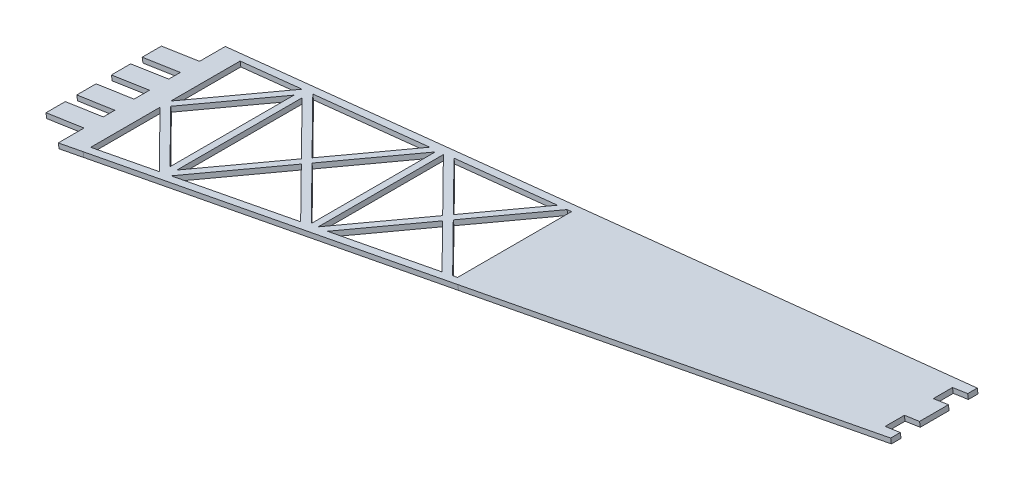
ISO-10303-21;
HEADER;
FILE_DESCRIPTION(('STEP AP214'),'2;1');
FILE_NAME('part.step','',(''),(''),'','','');
FILE_SCHEMA(('AUTOMOTIVE_DESIGN { 1 0 10303 214 1 1 1 1 }'));
ENDSEC;
DATA;
#1=APPLICATION_CONTEXT('core data for automotive mechanical design processes');
#2=APPLICATION_PROTOCOL_DEFINITION('international standard','automotive_design',2000,#1);
#3=PRODUCT_CONTEXT('',#1,'mechanical');
#4=PRODUCT('Part','Part','',(#3));
#5=PRODUCT_RELATED_PRODUCT_CATEGORY('part','',(#4));
#6=PRODUCT_DEFINITION_FORMATION('','',#4);
#7=PRODUCT_DEFINITION_CONTEXT('part definition',#1,'design');
#8=PRODUCT_DEFINITION('design','',#6,#7);
#9=PRODUCT_DEFINITION_SHAPE('','',#8);
#10=(LENGTH_UNIT() NAMED_UNIT(*) SI_UNIT(.MILLI.,.METRE.));
#11=(NAMED_UNIT(*) PLANE_ANGLE_UNIT() SI_UNIT($,.RADIAN.));
#12=(NAMED_UNIT(*) SI_UNIT($,.STERADIAN.) SOLID_ANGLE_UNIT());
#13=UNCERTAINTY_MEASURE_WITH_UNIT(LENGTH_MEASURE(1.E-05),#10,'distance_accuracy_value','');
#14=(GEOMETRIC_REPRESENTATION_CONTEXT(3) GLOBAL_UNCERTAINTY_ASSIGNED_CONTEXT((#13)) GLOBAL_UNIT_ASSIGNED_CONTEXT((#10,
#11,#12)) REPRESENTATION_CONTEXT('',''));
#15=CARTESIAN_POINT('',(0.,0.,0.));
#16=DIRECTION('',(0.,0.,1.));
#17=DIRECTION('',(1.,0.,0.));
#18=AXIS2_PLACEMENT_3D('',#15,#16,#17);
#19=CARTESIAN_POINT('',(-98.0745799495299,1596.7086115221,-114.3));
#20=DIRECTION('',(0.0506743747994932,0.,-0.998715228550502));
#21=DIRECTION('',(-0.998715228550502,0.,-0.0506743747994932));
#22=AXIS2_PLACEMENT_3D('',#19,#20,#21);
#23=PLANE('',#22);
#24=DIRECTION('',(0.987410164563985,0.150036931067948,0.0501007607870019));
#25=VECTOR('',#24,1.);
#26=CARTESIAN_POINT('',(-7.7165070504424,1000.52087684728,-109.715270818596));
#27=LINE('',#26,#25);
#28=CARTESIAN_POINT('',(-42.0566839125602,995.302888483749,-111.457676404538));
#29=VERTEX_POINT('',#28);
#30=CARTESIAN_POINT('',(193.292161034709,1031.06413512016,-99.5161787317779));
#31=VERTEX_POINT('',#30);
#32=EDGE_CURVE('E1605',#29,#31,#27,.T.);
#33=ORIENTED_EDGE('',*,*,#32,.T.);
#34=DIRECTION('',(0.150221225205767,-0.988623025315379,0.00762215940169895));
#35=VECTOR('',#34,1.);
#36=CARTESIAN_POINT('',(102.695045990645,1627.2940875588,-104.113036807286));
#37=LINE('',#36,#35);
#38=CARTESIAN_POINT('',(193.769127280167,1027.92516583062,-99.491977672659));
#39=VERTEX_POINT('',#38);
#40=EDGE_CURVE('E654',#31,#39,#37,.T.);
#41=ORIENTED_EDGE('',*,*,#40,.T.);
#42=DIRECTION('',(0.987410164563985,0.150036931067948,0.0501007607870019));
#43=VECTOR('',#42,1.);
#44=CARTESIAN_POINT('',(-98.0745799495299,983.579527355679,-114.3));
#45=LINE('',#44,#43);
#46=CARTESIAN_POINT('',(-41.5797176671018,992.163919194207,-111.433475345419));
#47=VERTEX_POINT('',#46);
#48=EDGE_CURVE('E1082',#47,#39,#45,.T.);
#49=ORIENTED_EDGE('',*,*,#48,.F.);
#50=DIRECTION('',(-0.150221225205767,0.988623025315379,-0.00762215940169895));
#51=VECTOR('',#50,1.);
#52=CARTESIAN_POINT('',(-132.640125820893,1591.44285645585,-116.053840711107));
#53=LINE('',#52,#51);
#54=EDGE_CURVE('E1314',#47,#29,#53,.T.);
#55=ORIENTED_EDGE('',*,*,#54,.T.);
#56=EDGE_LOOP('',(#33,#41,#49,#55));
#57=FACE_BOUND('',#56,.T.);
#58=ADVANCED_FACE('F631',(#57),#23,.T.);
#59=CARTESIAN_POINT('',(-98.0745799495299,1596.7086115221,0.));
#60=DIRECTION('',(-0.0506743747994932,0.,-0.998715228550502));
#61=DIRECTION('',(-0.998715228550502,0.,0.0506743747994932));
#62=AXIS2_PLACEMENT_3D('',#59,#60,#61);
#63=PLANE('',#62);
#64=DIRECTION('',(0.150221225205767,-0.988623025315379,-0.00762215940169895));
#65=VECTOR('',#64,1.);
#66=CARTESIAN_POINT('',(102.695045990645,1627.2940875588,-10.1869631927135));
#67=LINE('',#66,#65);
#68=CARTESIAN_POINT('',(193.292161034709,1031.06413512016,-14.7838212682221));
#69=VERTEX_POINT('',#68);
#70=CARTESIAN_POINT('',(193.769127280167,1027.92516583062,-14.8080223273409));
#71=VERTEX_POINT('',#70);
#72=EDGE_CURVE('E1143',#69,#71,#67,.T.);
#73=ORIENTED_EDGE('',*,*,#72,.F.);
#74=DIRECTION('',(0.987410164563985,0.150036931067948,-0.0501007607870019));
#75=VECTOR('',#74,1.);
#76=CARTESIAN_POINT('',(-7.7165070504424,1000.52087684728,-4.58472918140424));
#77=LINE('',#76,#75);
#78=CARTESIAN_POINT('',(-42.0566839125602,995.302888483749,-2.84232359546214));
#79=VERTEX_POINT('',#78);
#80=EDGE_CURVE('E1600',#79,#69,#77,.T.);
#81=ORIENTED_EDGE('',*,*,#80,.F.);
#82=DIRECTION('',(-0.150221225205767,0.988623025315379,0.00762215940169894));
#83=VECTOR('',#82,1.);
#84=CARTESIAN_POINT('',(-132.640125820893,1591.44285645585,1.75384071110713));
#85=LINE('',#84,#83);
#86=CARTESIAN_POINT('',(-41.5797176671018,992.163919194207,-2.866524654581));
#87=VERTEX_POINT('',#86);
#88=EDGE_CURVE('E1310',#87,#79,#85,.T.);
#89=ORIENTED_EDGE('',*,*,#88,.F.);
#90=DIRECTION('',(0.987410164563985,0.150036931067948,-0.0501007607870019));
#91=VECTOR('',#90,1.);
#92=CARTESIAN_POINT('',(-92.4201588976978,984.438716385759,-0.286902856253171));
#93=LINE('',#92,#91);
#94=EDGE_CURVE('E1604',#87,#71,#93,.T.);
#95=ORIENTED_EDGE('',*,*,#94,.T.);
#96=EDGE_LOOP('',(#73,#81,#89,#95));
#97=FACE_BOUND('',#96,.T.);
#98=ADVANCED_FACE('F1850',(#97),#63,.F.);
#99=CARTESIAN_POINT('',(465.09542005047,1072.3646283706,-114.3));
#100=DIRECTION('',(-0.150225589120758,0.988651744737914,0.));
#101=DIRECTION('',(-0.988651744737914,-0.150225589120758,0.));
#102=AXIS2_PLACEMENT_3D('',#99,#100,#101);
#103=PLANE('',#102);
#104=DIRECTION('',(-0.987410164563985,-0.150036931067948,-0.0501007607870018));
#105=VECTOR('',#104,1.);
#106=CARTESIAN_POINT('',(-142.990619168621,979.965981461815,-116.579020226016));
#107=LINE('',#106,#105);
#108=CARTESIAN_POINT('',(465.09542005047,1072.3646283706,-85.725));
#109=VERTEX_POINT('',#108);
#110=EDGE_CURVE('E647',#109,#31,#107,.T.);
#111=ORIENTED_EDGE('',*,*,#110,.T.);
#112=ORIENTED_EDGE('',*,*,#32,.F.);
#113=CARTESIAN_POINT('',(-57.6296767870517,992.936572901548,-112.247843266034));
#114=VERTEX_POINT('',#113);
#115=EDGE_CURVE('E1601',#114,#29,#27,.T.);
#116=ORIENTED_EDGE('',*,*,#115,.F.);
#117=DIRECTION('',(0.,0.,-1.));
#118=VECTOR('',#117,1.);
#119=CARTESIAN_POINT('',(-57.6296767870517,992.936572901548,-114.3));
#120=LINE('',#119,#118);
#121=CARTESIAN_POINT('',(-57.6296767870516,992.936572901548,-95.25));
#122=VERTEX_POINT('',#121);
#123=EDGE_CURVE('E1227',#122,#114,#120,.T.);
#124=ORIENTED_EDGE('',*,*,#123,.F.);
#125=DIRECTION('',(-0.988651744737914,-0.150225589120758,0.));
#126=VECTOR('',#125,1.);
#127=CARTESIAN_POINT('',(465.09542005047,1072.3646283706,-95.25));
#128=LINE('',#127,#126);
#129=CARTESIAN_POINT('',(-82.7414311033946,989.120842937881,-95.25));
#130=VERTEX_POINT('',#129);
#131=EDGE_CURVE('E1230',#122,#130,#128,.T.);
#132=ORIENTED_EDGE('',*,*,#131,.T.);
#133=DIRECTION('',(0.,0.,-1.));
#134=VECTOR('',#133,1.);
#135=CARTESIAN_POINT('',(-82.7414311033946,989.120842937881,-114.3));
#136=LINE('',#135,#134);
#137=CARTESIAN_POINT('',(-82.7414311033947,989.120842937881,-82.55));
#138=VERTEX_POINT('',#137);
#139=EDGE_CURVE('E1815',#138,#130,#136,.T.);
#140=ORIENTED_EDGE('',*,*,#139,.F.);
#141=DIRECTION('',(0.988651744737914,0.150225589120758,0.));
#142=VECTOR('',#141,1.);
#143=CARTESIAN_POINT('',(465.09542005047,1072.3646283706,-82.55));
#144=LINE('',#143,#142);
#145=CARTESIAN_POINT('',(-57.6296767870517,992.936572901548,-82.55));
#146=VERTEX_POINT('',#145);
#147=EDGE_CURVE('E1234',#138,#146,#144,.T.);
#148=ORIENTED_EDGE('',*,*,#147,.T.);
#149=DIRECTION('',(0.,0.,1.));
#150=VECTOR('',#149,1.);
#151=CARTESIAN_POINT('',(-57.6296767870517,992.936572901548,-114.3));
#152=LINE('',#151,#150);
#153=CARTESIAN_POINT('',(-57.6296767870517,992.936572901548,-74.93));
#154=VERTEX_POINT('',#153);
#155=EDGE_CURVE('E1242',#146,#154,#152,.T.);
#156=ORIENTED_EDGE('',*,*,#155,.T.);
#157=DIRECTION('',(-0.988651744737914,-0.150225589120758,0.));
#158=VECTOR('',#157,1.);
#159=CARTESIAN_POINT('',(465.09542005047,1072.3646283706,-74.93));
#160=LINE('',#159,#158);
#161=CARTESIAN_POINT('',(-82.7414311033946,989.120842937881,-74.93));
#162=VERTEX_POINT('',#161);
#163=EDGE_CURVE('E1238',#154,#162,#160,.T.);
#164=ORIENTED_EDGE('',*,*,#163,.T.);
#165=CARTESIAN_POINT('',(-82.7414311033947,989.120842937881,-62.23));
#166=VERTEX_POINT('',#165);
#167=EDGE_CURVE('E1156',#166,#162,#136,.T.);
#168=ORIENTED_EDGE('',*,*,#167,.F.);
#169=DIRECTION('',(-0.988651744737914,-0.150225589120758,0.));
#170=VECTOR('',#169,1.);
#171=CARTESIAN_POINT('',(465.09542005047,1072.3646283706,-62.2300000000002));
#172=LINE('',#171,#170);
#173=CARTESIAN_POINT('',(-57.6296767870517,992.936572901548,-62.23));
#174=VERTEX_POINT('',#173);
#175=EDGE_CURVE('E1246',#174,#166,#172,.T.);
#176=ORIENTED_EDGE('',*,*,#175,.F.);
#177=DIRECTION('',(0.,0.,1.));
#178=VECTOR('',#177,1.);
#179=CARTESIAN_POINT('',(-57.6296767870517,992.936572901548,-114.3));
#180=LINE('',#179,#178);
#181=CARTESIAN_POINT('',(-57.6296767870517,992.936572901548,-52.07));
#182=VERTEX_POINT('',#181);
#183=EDGE_CURVE('E1254',#174,#182,#180,.T.);
#184=ORIENTED_EDGE('',*,*,#183,.T.);
#185=DIRECTION('',(-0.988651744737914,-0.150225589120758,0.));
#186=VECTOR('',#185,1.);
#187=CARTESIAN_POINT('',(465.09542005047,1072.3646283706,-52.0700000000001));
#188=LINE('',#187,#186);
#189=CARTESIAN_POINT('',(-82.7414311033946,989.120842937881,-52.07));
#190=VERTEX_POINT('',#189);
#191=EDGE_CURVE('E1250',#182,#190,#188,.T.);
#192=ORIENTED_EDGE('',*,*,#191,.T.);
#193=CARTESIAN_POINT('',(-82.7414311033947,989.120842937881,-39.37));
#194=VERTEX_POINT('',#193);
#195=EDGE_CURVE('E1146',#194,#190,#136,.T.);
#196=ORIENTED_EDGE('',*,*,#195,.F.);
#197=DIRECTION('',(0.988651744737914,0.150225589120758,0.));
#198=VECTOR('',#197,1.);
#199=CARTESIAN_POINT('',(465.09542005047,1072.3646283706,-39.3700000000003));
#200=LINE('',#199,#198);
#201=CARTESIAN_POINT('',(-57.6296767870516,992.936572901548,-39.37));
#202=VERTEX_POINT('',#201);
#203=EDGE_CURVE('E1258',#194,#202,#200,.T.);
#204=ORIENTED_EDGE('',*,*,#203,.T.);
#205=DIRECTION('',(0.,0.,1.));
#206=VECTOR('',#205,1.);
#207=CARTESIAN_POINT('',(-57.6296767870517,992.936572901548,-114.3));
#208=LINE('',#207,#206);
#209=CARTESIAN_POINT('',(-57.6296767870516,992.936572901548,-31.75));
#210=VERTEX_POINT('',#209);
#211=EDGE_CURVE('E1265',#202,#210,#208,.T.);
#212=ORIENTED_EDGE('',*,*,#211,.T.);
#213=DIRECTION('',(0.988651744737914,0.150225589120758,0.));
#214=VECTOR('',#213,1.);
#215=CARTESIAN_POINT('',(465.09542005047,1072.3646283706,-31.7500000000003));
#216=LINE('',#215,#214);
#217=CARTESIAN_POINT('',(-82.7414311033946,989.120842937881,-31.75));
#218=VERTEX_POINT('',#217);
#219=EDGE_CURVE('E1262',#218,#210,#216,.T.);
#220=ORIENTED_EDGE('',*,*,#219,.F.);
#221=CARTESIAN_POINT('',(-82.7414311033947,989.120842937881,-19.05));
#222=VERTEX_POINT('',#221);
#223=EDGE_CURVE('E1151',#222,#218,#136,.T.);
#224=ORIENTED_EDGE('',*,*,#223,.F.);
#225=DIRECTION('',(-0.988651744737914,-0.150225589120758,0.));
#226=VECTOR('',#225,1.);
#227=CARTESIAN_POINT('',(465.09542005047,1072.3646283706,-19.05));
#228=LINE('',#227,#226);
#229=CARTESIAN_POINT('',(-57.6296767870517,992.936572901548,-19.05));
#230=VERTEX_POINT('',#229);
#231=EDGE_CURVE('E1269',#230,#222,#228,.T.);
#232=ORIENTED_EDGE('',*,*,#231,.F.);
#233=DIRECTION('',(0.,0.,1.));
#234=VECTOR('',#233,1.);
#235=CARTESIAN_POINT('',(-57.6296767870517,992.936572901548,-114.3));
#236=LINE('',#235,#234);
#237=CARTESIAN_POINT('',(-57.6296767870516,992.936572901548,-2.05215673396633));
#238=VERTEX_POINT('',#237);
#239=EDGE_CURVE('E1217',#230,#238,#236,.T.);
#240=ORIENTED_EDGE('',*,*,#239,.T.);
#241=DIRECTION('',(-0.987410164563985,-0.150036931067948,0.050100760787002));
#242=VECTOR('',#241,1.);
#243=CARTESIAN_POINT('',(-148.645040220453,979.106792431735,2.56592308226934));
#244=LINE('',#243,#242);
#245=EDGE_CURVE('E1279',#79,#238,#244,.T.);
#246=ORIENTED_EDGE('',*,*,#245,.F.);
#247=ORIENTED_EDGE('',*,*,#80,.T.);
#248=DIRECTION('',(0.987410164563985,0.150036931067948,-0.0501007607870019));
#249=VECTOR('',#248,1.);
#250=CARTESIAN_POINT('',(-148.645040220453,979.106792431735,2.56592308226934));
#251=LINE('',#250,#249);
#252=CARTESIAN_POINT('',(465.09542005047,1072.3646283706,-28.575));
#253=VERTEX_POINT('',#252);
#254=EDGE_CURVE('E1096',#69,#253,#251,.T.);
#255=ORIENTED_EDGE('',*,*,#254,.T.);
#256=DIRECTION('',(0.,0.,1.));
#257=VECTOR('',#256,1.);
#258=CARTESIAN_POINT('',(465.09542005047,1072.3646283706,-114.3));
#259=LINE('',#258,#257);
#260=CARTESIAN_POINT('',(465.09542005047,1072.3646283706,-34.925));
#261=VERTEX_POINT('',#260);
#262=EDGE_CURVE('E1614',#261,#253,#259,.T.);
#263=ORIENTED_EDGE('',*,*,#262,.F.);
#264=DIRECTION('',(-0.988651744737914,-0.150225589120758,0.));
#265=VECTOR('',#264,1.);
#266=CARTESIAN_POINT('',(12.7978461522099,1003.63803191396,-34.925));
#267=LINE('',#266,#265);
#268=CARTESIAN_POINT('',(455.09542005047,1070.84512881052,-34.925));
#269=VERTEX_POINT('',#268);
#270=EDGE_CURVE('E1573',#261,#269,#267,.T.);
#271=ORIENTED_EDGE('',*,*,#270,.T.);
#272=DIRECTION('',(0.,0.,1.));
#273=VECTOR('',#272,1.);
#274=CARTESIAN_POINT('',(455.09542005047,1070.84512881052,-3.95580059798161E-12));
#275=LINE('',#274,#273);
#276=CARTESIAN_POINT('',(455.09542005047,1070.84512881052,-47.625));
#277=VERTEX_POINT('',#276);
#278=EDGE_CURVE('E1580',#277,#269,#275,.T.);
#279=ORIENTED_EDGE('',*,*,#278,.F.);
#280=DIRECTION('',(-0.988651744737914,-0.150225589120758,0.));
#281=VECTOR('',#280,1.);
#282=CARTESIAN_POINT('',(12.7978461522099,1003.63803191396,-47.625));
#283=LINE('',#282,#281);
#284=CARTESIAN_POINT('',(465.09542005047,1072.3646283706,-47.625));
#285=VERTEX_POINT('',#284);
#286=EDGE_CURVE('E1560',#285,#277,#283,.T.);
#287=ORIENTED_EDGE('',*,*,#286,.F.);
#288=CARTESIAN_POINT('',(465.09542005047,1072.3646283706,-66.675));
#289=VERTEX_POINT('',#288);
#290=EDGE_CURVE('E1620',#289,#285,#259,.T.);
#291=ORIENTED_EDGE('',*,*,#290,.F.);
#292=DIRECTION('',(-0.988651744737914,-0.150225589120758,0.));
#293=VECTOR('',#292,1.);
#294=CARTESIAN_POINT('',(12.7978461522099,1003.63803191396,-66.675));
#295=LINE('',#294,#293);
#296=CARTESIAN_POINT('',(455.09542005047,1070.84512881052,-66.675));
#297=VERTEX_POINT('',#296);
#298=EDGE_CURVE('E1563',#289,#297,#295,.T.);
#299=ORIENTED_EDGE('',*,*,#298,.T.);
#300=DIRECTION('',(0.,0.,1.));
#301=VECTOR('',#300,1.);
#302=CARTESIAN_POINT('',(455.09542005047,1070.84512881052,0.));
#303=LINE('',#302,#301);
#304=CARTESIAN_POINT('',(455.09542005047,1070.84512881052,-79.375));
#305=VERTEX_POINT('',#304);
#306=EDGE_CURVE('E1568',#305,#297,#303,.T.);
#307=ORIENTED_EDGE('',*,*,#306,.F.);
#308=DIRECTION('',(-0.988651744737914,-0.150225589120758,0.));
#309=VECTOR('',#308,1.);
#310=CARTESIAN_POINT('',(12.7978461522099,1003.63803191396,-79.375));
#311=LINE('',#310,#309);
#312=CARTESIAN_POINT('',(465.09542005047,1072.3646283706,-79.375));
#313=VERTEX_POINT('',#312);
#314=EDGE_CURVE('E1569',#313,#305,#311,.T.);
#315=ORIENTED_EDGE('',*,*,#314,.F.);
#316=EDGE_CURVE('E1615',#109,#313,#259,.T.);
#317=ORIENTED_EDGE('',*,*,#316,.F.);
#318=EDGE_LOOP('',(#111,#112,#116,#124,#132,#140,#148,#156,#164,#168,#176,#184,#192,#196,#204,
#212,#220,#224,#232,#240,#246,#247,#255,#263,#271,#279,#287,#291,#299,#307,#315,#317));
#319=FACE_BOUND('',#318,.T.);
#320=DIRECTION('',(-0.987410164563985,-0.150036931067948,-0.0501007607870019));
#321=VECTOR('',#320,1.);
#322=CARTESIAN_POINT('',(-143.238280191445,979.928349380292,-111.585299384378));
#323=LINE('',#322,#321);
#324=CARTESIAN_POINT('',(188.348902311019,1030.31300717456,-94.7607104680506));
#325=VERTEX_POINT('',#324);
#326=CARTESIAN_POINT('',(185.242175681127,1029.84094019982,-94.918344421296));
#327=VERTEX_POINT('',#326);
#328=EDGE_CURVE('E1338',#325,#327,#323,.T.);
#329=ORIENTED_EDGE('',*,*,#328,.F.);
#330=DIRECTION('',(0.,0.,-1.));
#331=VECTOR('',#330,1.);
#332=CARTESIAN_POINT('',(188.348902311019,1030.31300717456,0.));
#333=LINE('',#332,#331);
#334=CARTESIAN_POINT('',(188.348902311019,1030.31300717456,-19.5392895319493));
#335=VERTEX_POINT('',#334);
#336=EDGE_CURVE('E1359',#335,#325,#333,.T.);
#337=ORIENTED_EDGE('',*,*,#336,.F.);
#338=DIRECTION('',(0.987410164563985,0.150036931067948,-0.0501007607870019));
#339=VECTOR('',#338,1.);
#340=CARTESIAN_POINT('',(-148.892701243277,979.069160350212,-2.42779775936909));
#341=LINE('',#340,#339);
#342=CARTESIAN_POINT('',(185.241958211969,1029.84090715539,-19.3816445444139));
#343=VERTEX_POINT('',#342);
#344=EDGE_CURVE('E1355',#343,#335,#341,.T.);
#345=ORIENTED_EDGE('',*,*,#344,.F.);
#346=DIRECTION('',(0.69908780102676,0.10622636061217,0.707101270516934));
#347=VECTOR('',#346,1.);
#348=CARTESIAN_POINT('',(27.8130764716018,1005.91959550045,-178.615094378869));
#349=LINE('',#348,#347);
#350=CARTESIAN_POINT('',(147.902321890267,1024.16715105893,-57.1492958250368));
#351=VERTEX_POINT('',#350);
#352=EDGE_CURVE('E1351',#351,#343,#349,.T.);
#353=ORIENTED_EDGE('',*,*,#352,.F.);
#354=DIRECTION('',(-0.699076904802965,-0.106224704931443,0.707112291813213));
#355=VECTOR('',#354,1.);
#356=CARTESIAN_POINT('',(-28.6830504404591,997.33501150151,121.465798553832));
#357=LINE('',#356,#355);
#358=EDGE_CURVE('E1347',#327,#351,#357,.T.);
#359=ORIENTED_EDGE('',*,*,#358,.F.);
#360=EDGE_LOOP('',(#329,#337,#345,#353,#359));
#361=FACE_BOUND('',#360,.T.);
#362=DIRECTION('',(0.69908780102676,0.10622636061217,0.707101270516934));
#363=VECTOR('',#362,1.);
#364=CARTESIAN_POINT('',(-65.4172537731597,991.753250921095,-84.3131484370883));
#365=LINE('',#364,#363);
#366=CARTESIAN_POINT('',(-38.5612449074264,995.83402028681,-57.1492958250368));
#367=VERTEX_POINT('',#366);
#368=CARTESIAN_POINT('',(1.88533551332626,1001.97987640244,-16.2390863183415));
#369=VERTEX_POINT('',#368);
#370=EDGE_CURVE('E1525',#367,#369,#365,.T.);
#371=ORIENTED_EDGE('',*,*,#370,.F.);
#372=DIRECTION('',(-0.699076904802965,-0.106224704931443,0.707112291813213));
#373=VECTOR('',#372,1.);
#374=CARTESIAN_POINT('',(-121.91628699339,983.168225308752,27.1638526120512));
#375=LINE('',#374,#373);
#376=CARTESIAN_POINT('',(1.88533551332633,1001.97987640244,-98.0607806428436));
#377=VERTEX_POINT('',#376);
#378=EDGE_CURVE('E1535',#377,#367,#375,.T.);
#379=ORIENTED_EDGE('',*,*,#378,.F.);
#380=DIRECTION('',(0.,0.,-1.));
#381=VECTOR('',#380,1.);
#382=CARTESIAN_POINT('',(1.88533551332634,1001.97987640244,0.));
#383=LINE('',#382,#381);
#384=EDGE_CURVE('E1531',#369,#377,#383,.T.);
#385=ORIENTED_EDGE('',*,*,#384,.F.);
#386=EDGE_LOOP('',(#371,#379,#385));
#387=FACE_BOUND('',#386,.T.);
#388=DIRECTION('',(0.,0.,-1.));
#389=VECTOR('',#388,1.);
#390=CARTESIAN_POINT('',(95.1171189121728,1016.1464417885,0.));
#391=LINE('',#390,#389);
#392=CARTESIAN_POINT('',(95.1171189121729,1016.1464417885,-16.2390863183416));
#393=VERTEX_POINT('',#392);
#394=CARTESIAN_POINT('',(95.1171189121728,1016.1464417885,-98.0607806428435));
#395=VERTEX_POINT('',#394);
#396=EDGE_CURVE('E1439',#393,#395,#391,.T.);
#397=ORIENTED_EDGE('',*,*,#396,.F.);
#398=DIRECTION('',(0.69908780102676,0.10622636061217,0.707101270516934));
#399=VECTOR('',#398,1.);
#400=CARTESIAN_POINT('',(-18.802088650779,998.836423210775,-131.464121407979));
#401=LINE('',#400,#399);
#402=CARTESIAN_POINT('',(54.6705384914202,1010.00058567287,-57.1492958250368));
#403=VERTEX_POINT('',#402);
#404=EDGE_CURVE('E1452',#403,#393,#401,.T.);
#405=ORIENTED_EDGE('',*,*,#404,.F.);
#406=DIRECTION('',(-0.699076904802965,-0.106224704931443,0.707112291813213));
#407=VECTOR('',#406,1.);
#408=CARTESIAN_POINT('',(-75.2996687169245,990.251618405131,74.3148255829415));
#409=LINE('',#408,#407);
#410=EDGE_CURVE('E1448',#395,#403,#409,.T.);
#411=ORIENTED_EDGE('',*,*,#410,.F.);
#412=EDGE_LOOP('',(#397,#405,#411));
#413=FACE_BOUND('',#412,.T.);
#414=DIRECTION('',(-0.987410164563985,-0.150036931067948,-0.0501007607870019));
#415=VECTOR('',#414,1.);
#416=CARTESIAN_POINT('',(-143.238280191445,979.928349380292,-111.585299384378));
#417=LINE('',#416,#415);
#418=CARTESIAN_POINT('',(89.8069387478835,1015.33956014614,-99.7606866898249));
#419=VERTEX_POINT('',#418);
#420=CARTESIAN_POINT('',(8.46139411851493,1002.97910821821,-103.888124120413));
#421=VERTEX_POINT('',#420);
#422=EDGE_CURVE('E1470',#419,#421,#417,.T.);
#423=ORIENTED_EDGE('',*,*,#422,.F.);
#424=DIRECTION('',(-0.699076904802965,-0.106224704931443,0.707112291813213));
#425=VECTOR('',#424,1.);
#426=CARTESIAN_POINT('',(-78.7951077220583,989.72048660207,70.7793192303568));
#427=LINE('',#426,#425);
#428=CARTESIAN_POINT('',(51.1750994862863,1009.46945386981,-60.6848021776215));
#429=VERTEX_POINT('',#428);
#430=EDGE_CURVE('E1460',#419,#429,#427,.T.);
#431=ORIENTED_EDGE('',*,*,#430,.T.);
#432=DIRECTION('',(0.69908780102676,0.10622636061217,0.707101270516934));
#433=VECTOR('',#432,1.);
#434=CARTESIAN_POINT('',(-18.802088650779,998.836423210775,-131.464121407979));
#435=LINE('',#434,#433);
#436=EDGE_CURVE('E1474',#421,#429,#435,.T.);
#437=ORIENTED_EDGE('',*,*,#436,.F.);
#438=EDGE_LOOP('',(#423,#431,#437));
#439=FACE_BOUND('',#438,.T.);
#440=DIRECTION('',(0.69908780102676,0.10622636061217,0.707101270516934));
#441=VECTOR('',#440,1.);
#442=CARTESIAN_POINT('',(24.317691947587,1005.3884719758,-175.079532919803));
#443=LINE('',#442,#441);
#444=CARTESIAN_POINT('',(100.060377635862,1016.8975697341,-98.4686276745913));
#445=VERTEX_POINT('',#444);
#446=CARTESIAN_POINT('',(140.911498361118,1023.10489573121,-57.1492407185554));
#447=VERTEX_POINT('',#446);
#448=EDGE_CURVE('E1405',#445,#447,#443,.T.);
#449=ORIENTED_EDGE('',*,*,#448,.T.);
#450=DIRECTION('',(-0.699076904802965,-0.106224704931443,0.707112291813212));
#451=VECTOR('',#450,1.);
#452=CARTESIAN_POINT('',(-32.1784894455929,996.803879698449,117.930292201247));
#453=LINE('',#452,#451);
#454=CARTESIAN_POINT('',(100.060377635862,1016.8975697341,-15.8285656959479));
#455=VERTEX_POINT('',#454);
#456=EDGE_CURVE('E1395',#447,#455,#453,.T.);
#457=ORIENTED_EDGE('',*,*,#456,.T.);
#458=DIRECTION('',(0.,0.,-1.));
#459=VECTOR('',#458,1.);
#460=CARTESIAN_POINT('',(100.060377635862,1016.8975697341,0.));
#461=LINE('',#460,#459);
#462=EDGE_CURVE('E1409',#455,#445,#461,.T.);
#463=ORIENTED_EDGE('',*,*,#462,.T.);
#464=EDGE_LOOP('',(#449,#457,#463));
#465=FACE_BOUND('',#464,.T.);
#466=DIRECTION('',(-0.699076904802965,-0.106224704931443,0.707112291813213));
#467=VECTOR('',#466,1.);
#468=CARTESIAN_POINT('',(-75.2996687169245,990.251618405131,74.3148255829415));
#469=LINE('',#468,#467);
#470=CARTESIAN_POINT('',(51.1751539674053,1009.46946214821,-53.6137343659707));
#471=VERTEX_POINT('',#470);
#472=CARTESIAN_POINT('',(8.46437652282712,1002.97956139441,-10.4120272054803));
#473=VERTEX_POINT('',#472);
#474=EDGE_CURVE('E1427',#471,#473,#469,.T.);
#475=ORIENTED_EDGE('',*,*,#474,.F.);
#476=DIRECTION('',(0.69908780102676,0.10622636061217,0.707101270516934));
#477=VECTOR('',#476,1.);
#478=CARTESIAN_POINT('',(-22.2974731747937,998.305299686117,-127.928559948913));
#479=LINE('',#478,#477);
#480=CARTESIAN_POINT('',(89.8067596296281,1015.33953292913,-14.539304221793));
#481=VERTEX_POINT('',#480);
#482=EDGE_CURVE('E1417',#471,#481,#479,.T.);
#483=ORIENTED_EDGE('',*,*,#482,.T.);
#484=DIRECTION('',(0.987410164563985,0.150036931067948,-0.0501007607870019));
#485=VECTOR('',#484,1.);
#486=CARTESIAN_POINT('',(-148.892701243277,979.069160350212,-2.42779775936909));
#487=LINE('',#486,#485);
#488=EDGE_CURVE('E1431',#473,#481,#487,.T.);
#489=ORIENTED_EDGE('',*,*,#488,.F.);
#490=EDGE_LOOP('',(#475,#483,#489));
#491=FACE_BOUND('',#490,.T.);
#492=DIRECTION('',(-0.699076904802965,-0.106224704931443,0.707112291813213));
#493=VECTOR('',#492,1.);
#494=CARTESIAN_POINT('',(-78.7951077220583,989.72048660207,70.7793192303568));
#495=LINE('',#494,#493);
#496=CARTESIAN_POINT('',(47.6797149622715,1008.93833034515,-57.1492407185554));
#497=VERTEX_POINT('',#496);
#498=CARTESIAN_POINT('',(6.82859423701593,1002.73100434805,-15.8285656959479));
#499=VERTEX_POINT('',#498);
#500=EDGE_CURVE('E1492',#497,#499,#495,.T.);
#501=ORIENTED_EDGE('',*,*,#500,.T.);
#502=DIRECTION('',(0.,0.,-1.));
#503=VECTOR('',#502,1.);
#504=CARTESIAN_POINT('',(6.8285942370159,1002.73100434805,0.));
#505=LINE('',#504,#503);
#506=CARTESIAN_POINT('',(6.8285942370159,1002.73100434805,-98.4686276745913));
#507=VERTEX_POINT('',#506);
#508=EDGE_CURVE('E1482',#499,#507,#505,.T.);
#509=ORIENTED_EDGE('',*,*,#508,.T.);
#510=DIRECTION('',(0.69908780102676,0.10622636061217,0.707101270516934));
#511=VECTOR('',#510,1.);
#512=CARTESIAN_POINT('',(-22.2974731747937,998.305299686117,-127.928559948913));
#513=LINE('',#512,#511);
#514=EDGE_CURVE('E1496',#507,#497,#513,.T.);
#515=ORIENTED_EDGE('',*,*,#514,.T.);
#516=EDGE_LOOP('',(#501,#509,#515));
#517=FACE_BOUND('',#516,.T.);
#518=DIRECTION('',(-0.987410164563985,-0.150036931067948,-0.0501007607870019));
#519=VECTOR('',#518,1.);
#520=CARTESIAN_POINT('',(-143.238280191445,979.928349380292,-111.585299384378));
#521=LINE('',#520,#519);
#522=CARTESIAN_POINT('',(178.585333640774,1028.82943334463,-95.2561096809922));
#523=VERTEX_POINT('',#522);
#524=CARTESIAN_POINT('',(106.617114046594,1017.89386554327,-98.9077457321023));
#525=VERTEX_POINT('',#524);
#526=EDGE_CURVE('E1383',#523,#525,#521,.T.);
#527=ORIENTED_EDGE('',*,*,#526,.F.);
#528=DIRECTION('',(-0.699076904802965,-0.106224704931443,0.707112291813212));
#529=VECTOR('',#528,1.);
#530=CARTESIAN_POINT('',(-32.1784894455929,996.803879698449,117.930292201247));
#531=LINE('',#530,#529);
#532=CARTESIAN_POINT('',(144.406882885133,1023.63601925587,-60.6848021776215));
#533=VERTEX_POINT('',#532);
#534=EDGE_CURVE('E1367',#523,#533,#531,.T.);
#535=ORIENTED_EDGE('',*,*,#534,.T.);
#536=DIRECTION('',(0.69908780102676,0.10622636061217,0.707101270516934));
#537=VECTOR('',#536,1.);
#538=CARTESIAN_POINT('',(27.8130764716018,1005.91959550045,-178.615094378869));
#539=LINE('',#538,#537);
#540=EDGE_CURVE('E1387',#525,#533,#539,.T.);
#541=ORIENTED_EDGE('',*,*,#540,.F.);
#542=EDGE_LOOP('',(#527,#535,#541));
#543=FACE_BOUND('',#542,.T.);
#544=DIRECTION('',(-0.699076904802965,-0.106224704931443,0.707112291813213));
#545=VECTOR('',#544,1.);
#546=CARTESIAN_POINT('',(-28.6830504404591,997.33501150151,121.465798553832));
#547=LINE('',#546,#545);
#548=CARTESIAN_POINT('',(144.406937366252,1023.63602753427,-53.6137343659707));
#549=VERTEX_POINT('',#548);
#550=CARTESIAN_POINT('',(106.619934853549,1017.89429416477,-15.3923973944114));
#551=VERTEX_POINT('',#550);
#552=EDGE_CURVE('E1326',#549,#551,#547,.T.);
#553=ORIENTED_EDGE('',*,*,#552,.F.);
#554=DIRECTION('',(0.69908780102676,0.10622636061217,0.707101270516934));
#555=VECTOR('',#554,1.);
#556=CARTESIAN_POINT('',(24.317691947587,1005.3884719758,-175.079532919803));
#557=LINE('',#556,#555);
#558=CARTESIAN_POINT('',(178.585022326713,1028.82938604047,-19.0438745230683));
#559=VERTEX_POINT('',#558);
#560=EDGE_CURVE('E1322',#549,#559,#557,.T.);
#561=ORIENTED_EDGE('',*,*,#560,.T.);
#562=DIRECTION('',(0.987410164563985,0.150036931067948,-0.0501007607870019));
#563=VECTOR('',#562,1.);
#564=CARTESIAN_POINT('',(-148.892701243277,979.069160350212,-2.42779775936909));
#565=LINE('',#564,#563);
#566=EDGE_CURVE('E1330',#551,#559,#565,.T.);
#567=ORIENTED_EDGE('',*,*,#566,.F.);
#568=EDGE_LOOP('',(#553,#561,#567));
#569=FACE_BOUND('',#568,.T.);
#570=DIRECTION('',(0.,0.,1.));
#571=VECTOR('',#570,1.);
#572=CARTESIAN_POINT('',(-42.0566839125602,995.302888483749,2.33748537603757E-13));
#573=LINE('',#572,#571);
#574=CARTESIAN_POINT('',(-42.0566839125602,995.302888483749,-53.6136792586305));
#575=VERTEX_POINT('',#574);
#576=CARTESIAN_POINT('',(-42.0566839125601,995.302888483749,-7.84861064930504));
#577=VERTEX_POINT('',#576);
#578=EDGE_CURVE('E1274',#575,#577,#573,.T.);
#579=ORIENTED_EDGE('',*,*,#578,.F.);
#580=DIRECTION('',(-0.699076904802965,-0.106224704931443,0.707112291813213));
#581=VECTOR('',#580,1.);
#582=CARTESIAN_POINT('',(-121.91628699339,983.168225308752,27.1638526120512));
#583=LINE('',#582,#581);
#584=CARTESIAN_POINT('',(-42.0566294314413,995.302896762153,-53.6137343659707));
#585=VERTEX_POINT('',#584);
#586=EDGE_CURVE('E1514',#585,#575,#583,.T.);
#587=ORIENTED_EDGE('',*,*,#586,.F.);
#588=DIRECTION('',(0.69908780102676,0.10622636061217,0.707101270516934));
#589=VECTOR('',#588,1.);
#590=CARTESIAN_POINT('',(-68.9126382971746,991.222127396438,-80.7775869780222));
#591=LINE('',#590,#589);
#592=CARTESIAN_POINT('',(1.02849693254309,1001.84967981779,-10.0347339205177));
#593=VERTEX_POINT('',#592);
#594=EDGE_CURVE('E1504',#585,#593,#591,.T.);
#595=ORIENTED_EDGE('',*,*,#594,.T.);
#596=DIRECTION('',(0.987410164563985,0.150036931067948,-0.0501007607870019));
#597=VECTOR('',#596,1.);
#598=CARTESIAN_POINT('',(-148.892701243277,979.069160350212,-2.42779775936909));
#599=LINE('',#598,#597);
#600=EDGE_CURVE('E1517',#577,#593,#599,.T.);
#601=ORIENTED_EDGE('',*,*,#600,.F.);
#602=EDGE_LOOP('',(#579,#587,#595,#601));
#603=FACE_BOUND('',#602,.T.);
#604=CARTESIAN_POINT('',(-42.0566839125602,995.302888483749,-106.451389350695));
#605=VERTEX_POINT('',#604);
#606=CARTESIAN_POINT('',(-42.0566839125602,995.302888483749,-60.6848021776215));
#607=VERTEX_POINT('',#606);
#608=EDGE_CURVE('E1278',#605,#607,#573,.T.);
#609=ORIENTED_EDGE('',*,*,#608,.F.);
#610=DIRECTION('',(-0.987410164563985,-0.150036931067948,-0.0501007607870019));
#611=VECTOR('',#610,1.);
#612=CARTESIAN_POINT('',(-143.238280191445,979.928349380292,-111.585299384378));
#613=LINE('',#612,#611);
#614=CARTESIAN_POINT('',(1.02854385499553,1001.84968694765,-104.265263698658));
#615=VERTEX_POINT('',#614);
#616=EDGE_CURVE('E1553',#615,#605,#613,.T.);
#617=ORIENTED_EDGE('',*,*,#616,.F.);
#618=DIRECTION('',(-0.699076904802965,-0.106224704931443,0.707112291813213));
#619=VECTOR('',#618,1.);
#620=CARTESIAN_POINT('',(-125.411725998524,982.637093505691,23.6283462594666));
#621=LINE('',#620,#619);
#622=EDGE_CURVE('E1543',#615,#607,#621,.T.);
#623=ORIENTED_EDGE('',*,*,#622,.T.);
#624=EDGE_LOOP('',(#609,#617,#623));
#625=FACE_BOUND('',#624,.T.);
#626=ADVANCED_FACE('F633',(#319,#361,#387,#413,#439,#465,#491,#517,#543,#569,#603,#625),#103,.T.);
#627=CARTESIAN_POINT('',(-98.0745799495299,983.579527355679,-114.3));
#628=DIRECTION('',(0.150225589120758,-0.988651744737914,0.));
#629=DIRECTION('',(0.988651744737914,0.150225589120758,0.));
#630=AXIS2_PLACEMENT_3D('',#627,#628,#629);
#631=PLANE('',#630);
#632=DIRECTION('',(0.,0.,-1.));
#633=VECTOR('',#632,1.);
#634=CARTESIAN_POINT('',(193.769127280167,1027.92516583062,0.));
#635=LINE('',#634,#633);
#636=CARTESIAN_POINT('',(193.769127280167,1027.92516583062,-14.7838212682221));
#637=VERTEX_POINT('',#636);
#638=EDGE_CURVE('E1084',#637,#71,#635,.T.);
#639=ORIENTED_EDGE('',*,*,#638,.T.);
#640=ORIENTED_EDGE('',*,*,#94,.F.);
#641=DIRECTION('',(0.,0.,1.));
#642=VECTOR('',#641,1.);
#643=CARTESIAN_POINT('',(-41.5797176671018,992.163919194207,2.33748537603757E-13));
#644=LINE('',#643,#642);
#645=CARTESIAN_POINT('',(-41.5797176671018,992.163919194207,-2.84232359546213));
#646=VERTEX_POINT('',#645);
#647=EDGE_CURVE('E1294',#87,#646,#644,.T.);
#648=ORIENTED_EDGE('',*,*,#647,.T.);
#649=DIRECTION('',(-0.987410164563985,-0.150036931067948,0.050100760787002));
#650=VECTOR('',#649,1.);
#651=CARTESIAN_POINT('',(-148.168073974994,975.967823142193,2.56592308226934));
#652=LINE('',#651,#650);
#653=CARTESIAN_POINT('',(-57.1527105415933,989.797603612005,-2.05215673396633));
#654=VERTEX_POINT('',#653);
#655=EDGE_CURVE('E1285',#646,#654,#652,.T.);
#656=ORIENTED_EDGE('',*,*,#655,.T.);
#657=DIRECTION('',(0.,0.,-1.));
#658=VECTOR('',#657,1.);
#659=CARTESIAN_POINT('',(-57.1527105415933,989.797603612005,-114.3));
#660=LINE('',#659,#658);
#661=CARTESIAN_POINT('',(-57.1527105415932,989.797603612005,-19.05));
#662=VERTEX_POINT('',#661);
#663=EDGE_CURVE('E1160',#654,#662,#660,.T.);
#664=ORIENTED_EDGE('',*,*,#663,.T.);
#665=DIRECTION('',(0.988651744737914,0.150225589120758,0.));
#666=VECTOR('',#665,1.);
#667=CARTESIAN_POINT('',(-98.0745799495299,983.579527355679,-19.05));
#668=LINE('',#667,#666);
#669=CARTESIAN_POINT('',(-82.2644648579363,985.981873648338,-19.05));
#670=VERTEX_POINT('',#669);
#671=EDGE_CURVE('E12',#670,#662,#668,.T.);
#672=ORIENTED_EDGE('',*,*,#671,.F.);
#673=DIRECTION('',(0.,0.,1.));
#674=VECTOR('',#673,1.);
#675=CARTESIAN_POINT('',(-82.2644648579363,985.981873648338,-114.3));
#676=LINE('',#675,#674);
#677=CARTESIAN_POINT('',(-82.2644648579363,985.981873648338,-31.75));
#678=VERTEX_POINT('',#677);
#679=EDGE_CURVE('E1147',#678,#670,#676,.T.);
#680=ORIENTED_EDGE('',*,*,#679,.F.);
#681=DIRECTION('',(-0.988651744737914,-0.150225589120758,0.));
#682=VECTOR('',#681,1.);
#683=CARTESIAN_POINT('',(-98.0745799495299,983.579527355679,-31.75));
#684=LINE('',#683,#682);
#685=CARTESIAN_POINT('',(-57.1527105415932,989.797603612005,-31.75));
#686=VERTEX_POINT('',#685);
#687=EDGE_CURVE('E1783',#686,#678,#684,.T.);
#688=ORIENTED_EDGE('',*,*,#687,.F.);
#689=DIRECTION('',(0.,0.,-1.));
#690=VECTOR('',#689,1.);
#691=CARTESIAN_POINT('',(-57.1527105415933,989.797603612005,-114.3));
#692=LINE('',#691,#690);
#693=CARTESIAN_POINT('',(-57.1527105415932,989.797603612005,-39.37));
#694=VERTEX_POINT('',#693);
#695=EDGE_CURVE('E640',#686,#694,#692,.T.);
#696=ORIENTED_EDGE('',*,*,#695,.T.);
#697=DIRECTION('',(-0.988651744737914,-0.150225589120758,0.));
#698=VECTOR('',#697,1.);
#699=CARTESIAN_POINT('',(-98.0745799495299,983.579527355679,-39.37));
#700=LINE('',#699,#698);
#701=CARTESIAN_POINT('',(-82.2644648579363,985.981873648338,-39.37));
#702=VERTEX_POINT('',#701);
#703=EDGE_CURVE('E1779',#694,#702,#700,.T.);
#704=ORIENTED_EDGE('',*,*,#703,.T.);
#705=CARTESIAN_POINT('',(-82.2644648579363,985.981873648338,-52.07));
#706=VERTEX_POINT('',#705);
#707=EDGE_CURVE('E1153',#706,#702,#676,.T.);
#708=ORIENTED_EDGE('',*,*,#707,.F.);
#709=DIRECTION('',(0.988651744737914,0.150225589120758,0.));
#710=VECTOR('',#709,1.);
#711=CARTESIAN_POINT('',(-98.0745799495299,983.579527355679,-52.07));
#712=LINE('',#711,#710);
#713=CARTESIAN_POINT('',(-57.1527105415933,989.797603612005,-52.07));
#714=VERTEX_POINT('',#713);
#715=EDGE_CURVE('E1771',#706,#714,#712,.T.);
#716=ORIENTED_EDGE('',*,*,#715,.T.);
#717=DIRECTION('',(0.,0.,-1.));
#718=VECTOR('',#717,1.);
#719=CARTESIAN_POINT('',(-57.1527105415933,989.797603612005,-114.3));
#720=LINE('',#719,#718);
#721=CARTESIAN_POINT('',(-57.1527105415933,989.797603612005,-62.23));
#722=VERTEX_POINT('',#721);
#723=EDGE_CURVE('E1775',#714,#722,#720,.T.);
#724=ORIENTED_EDGE('',*,*,#723,.T.);
#725=DIRECTION('',(0.988651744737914,0.150225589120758,0.));
#726=VECTOR('',#725,1.);
#727=CARTESIAN_POINT('',(-98.0745799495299,983.579527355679,-62.23));
#728=LINE('',#727,#726);
#729=CARTESIAN_POINT('',(-82.2644648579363,985.981873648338,-62.23));
#730=VERTEX_POINT('',#729);
#731=EDGE_CURVE('E1768',#730,#722,#728,.T.);
#732=ORIENTED_EDGE('',*,*,#731,.F.);
#733=CARTESIAN_POINT('',(-82.2644648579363,985.981873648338,-74.93));
#734=VERTEX_POINT('',#733);
#735=EDGE_CURVE('E1812',#734,#730,#676,.T.);
#736=ORIENTED_EDGE('',*,*,#735,.F.);
#737=DIRECTION('',(0.988651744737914,0.150225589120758,0.));
#738=VECTOR('',#737,1.);
#739=CARTESIAN_POINT('',(-98.0745799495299,983.579527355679,-74.93));
#740=LINE('',#739,#738);
#741=CARTESIAN_POINT('',(-57.1527105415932,989.797603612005,-74.93));
#742=VERTEX_POINT('',#741);
#743=EDGE_CURVE('E1760',#734,#742,#740,.T.);
#744=ORIENTED_EDGE('',*,*,#743,.T.);
#745=DIRECTION('',(0.,0.,-1.));
#746=VECTOR('',#745,1.);
#747=CARTESIAN_POINT('',(-57.1527105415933,989.797603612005,-114.3));
#748=LINE('',#747,#746);
#749=CARTESIAN_POINT('',(-57.1527105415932,989.797603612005,-82.55));
#750=VERTEX_POINT('',#749);
#751=EDGE_CURVE('E1764',#742,#750,#748,.T.);
#752=ORIENTED_EDGE('',*,*,#751,.T.);
#753=DIRECTION('',(-0.988651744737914,-0.150225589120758,0.));
#754=VECTOR('',#753,1.);
#755=CARTESIAN_POINT('',(-98.0745799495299,983.579527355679,-82.55));
#756=LINE('',#755,#754);
#757=CARTESIAN_POINT('',(-82.2644648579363,985.981873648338,-82.55));
#758=VERTEX_POINT('',#757);
#759=EDGE_CURVE('E1756',#750,#758,#756,.T.);
#760=ORIENTED_EDGE('',*,*,#759,.T.);
#761=CARTESIAN_POINT('',(-82.2644648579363,985.981873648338,-95.25));
#762=VERTEX_POINT('',#761);
#763=EDGE_CURVE('E1152',#762,#758,#676,.T.);
#764=ORIENTED_EDGE('',*,*,#763,.F.);
#765=DIRECTION('',(0.988651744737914,0.150225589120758,0.));
#766=VECTOR('',#765,1.);
#767=CARTESIAN_POINT('',(-98.0745799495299,983.579527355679,-95.25));
#768=LINE('',#767,#766);
#769=CARTESIAN_POINT('',(-57.1527105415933,989.797603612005,-95.25));
#770=VERTEX_POINT('',#769);
#771=EDGE_CURVE('E1752',#762,#770,#768,.T.);
#772=ORIENTED_EDGE('',*,*,#771,.T.);
#773=DIRECTION('',(0.,0.,1.));
#774=VECTOR('',#773,1.);
#775=CARTESIAN_POINT('',(-57.1527105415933,989.797603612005,-114.3));
#776=LINE('',#775,#774);
#777=CARTESIAN_POINT('',(-57.1527105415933,989.797603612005,-112.24678569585));
#778=VERTEX_POINT('',#777);
#779=EDGE_CURVE('E1221',#778,#770,#776,.T.);
#780=ORIENTED_EDGE('',*,*,#779,.F.);
#781=DIRECTION('',(0.987413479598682,0.150037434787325,0.0500338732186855));
#782=VECTOR('',#781,1.);
#783=CARTESIAN_POINT('',(-142.52171046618,976.825787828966,-116.572574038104));
#784=LINE('',#783,#782);
#785=CARTESIAN_POINT('',(-41.5797176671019,992.163919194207,-111.457676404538));
#786=VERTEX_POINT('',#785);
#787=EDGE_CURVE('E1283',#778,#786,#784,.T.);
#788=ORIENTED_EDGE('',*,*,#787,.T.);
#789=EDGE_CURVE('E1290',#786,#47,#644,.T.);
#790=ORIENTED_EDGE('',*,*,#789,.T.);
#791=ORIENTED_EDGE('',*,*,#48,.T.);
#792=CARTESIAN_POINT('',(193.769127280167,1027.92516583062,-99.5161787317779));
#793=VERTEX_POINT('',#792);
#794=EDGE_CURVE('E1072',#39,#793,#635,.T.);
#795=ORIENTED_EDGE('',*,*,#794,.T.);
#796=DIRECTION('',(-0.987410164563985,-0.150036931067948,-0.0501007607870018));
#797=VECTOR('',#796,1.);
#798=CARTESIAN_POINT('',(-142.513652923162,976.827012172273,-116.579020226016));
#799=LINE('',#798,#797);
#800=CARTESIAN_POINT('',(465.572386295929,1069.22565908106,-85.725));
#801=VERTEX_POINT('',#800);
#802=EDGE_CURVE('E1079',#801,#793,#799,.T.);
#803=ORIENTED_EDGE('',*,*,#802,.F.);
#804=DIRECTION('',(0.,0.,-1.));
#805=VECTOR('',#804,1.);
#806=CARTESIAN_POINT('',(465.572386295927,1069.22565908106,1.07327570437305E-11));
#807=LINE('',#806,#805);
#808=CARTESIAN_POINT('',(465.572386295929,1069.22565908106,-79.375));
#809=VERTEX_POINT('',#808);
#810=EDGE_CURVE('E1103',#809,#801,#807,.T.);
#811=ORIENTED_EDGE('',*,*,#810,.F.);
#812=DIRECTION('',(-0.988651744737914,-0.150225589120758,0.));
#813=VECTOR('',#812,1.);
#814=CARTESIAN_POINT('',(-98.0745799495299,983.579527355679,-79.375));
#815=LINE('',#814,#813);
#816=CARTESIAN_POINT('',(455.572386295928,1067.70615952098,-79.375));
#817=VERTEX_POINT('',#816);
#818=EDGE_CURVE('E1593',#809,#817,#815,.T.);
#819=ORIENTED_EDGE('',*,*,#818,.T.);
#820=DIRECTION('',(0.,0.,-1.));
#821=VECTOR('',#820,1.);
#822=CARTESIAN_POINT('',(455.572386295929,1067.70615952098,0.));
#823=LINE('',#822,#821);
#824=CARTESIAN_POINT('',(455.572386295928,1067.70615952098,-66.675));
#825=VERTEX_POINT('',#824);
#826=EDGE_CURVE('E1106',#825,#817,#823,.T.);
#827=ORIENTED_EDGE('',*,*,#826,.F.);
#828=DIRECTION('',(-0.988651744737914,-0.150225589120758,0.));
#829=VECTOR('',#828,1.);
#830=CARTESIAN_POINT('',(-98.0745799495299,983.579527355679,-66.675));
#831=LINE('',#830,#829);
#832=CARTESIAN_POINT('',(465.572386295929,1069.22565908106,-66.675));
#833=VERTEX_POINT('',#832);
#834=EDGE_CURVE('E1597',#833,#825,#831,.T.);
#835=ORIENTED_EDGE('',*,*,#834,.F.);
#836=DIRECTION('',(0.,0.,-1.));
#837=VECTOR('',#836,1.);
#838=CARTESIAN_POINT('',(465.572386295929,1069.22565908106,0.));
#839=LINE('',#838,#837);
#840=CARTESIAN_POINT('',(465.572386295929,1069.22565908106,-47.625));
#841=VERTEX_POINT('',#840);
#842=EDGE_CURVE('E1111',#841,#833,#839,.T.);
#843=ORIENTED_EDGE('',*,*,#842,.F.);
#844=DIRECTION('',(-0.988651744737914,-0.150225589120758,0.));
#845=VECTOR('',#844,1.);
#846=CARTESIAN_POINT('',(-98.0745799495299,983.579527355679,-47.625));
#847=LINE('',#846,#845);
#848=CARTESIAN_POINT('',(455.572386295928,1067.70615952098,-47.625));
#849=VERTEX_POINT('',#848);
#850=EDGE_CURVE('E1567',#841,#849,#847,.T.);
#851=ORIENTED_EDGE('',*,*,#850,.T.);
#852=DIRECTION('',(0.,0.,-1.));
#853=VECTOR('',#852,1.);
#854=CARTESIAN_POINT('',(455.572386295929,1067.70615952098,-5.27895938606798E-12));
#855=LINE('',#854,#853);
#856=CARTESIAN_POINT('',(455.572386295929,1067.70615952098,-34.925));
#857=VERTEX_POINT('',#856);
#858=EDGE_CURVE('E1116',#857,#849,#855,.T.);
#859=ORIENTED_EDGE('',*,*,#858,.F.);
#860=DIRECTION('',(-0.988651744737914,-0.150225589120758,0.));
#861=VECTOR('',#860,1.);
#862=CARTESIAN_POINT('',(-98.0745799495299,983.579527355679,-34.925));
#863=LINE('',#862,#861);
#864=CARTESIAN_POINT('',(465.572386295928,1069.22565908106,-34.925));
#865=VERTEX_POINT('',#864);
#866=EDGE_CURVE('E1590',#865,#857,#863,.T.);
#867=ORIENTED_EDGE('',*,*,#866,.F.);
#868=DIRECTION('',(0.,0.,-1.));
#869=VECTOR('',#868,1.);
#870=CARTESIAN_POINT('',(465.572386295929,1069.22565908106,-1.07327570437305E-11));
#871=LINE('',#870,#869);
#872=CARTESIAN_POINT('',(465.572386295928,1069.22565908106,-28.575));
#873=VERTEX_POINT('',#872);
#874=EDGE_CURVE('E1121',#873,#865,#871,.T.);
#875=ORIENTED_EDGE('',*,*,#874,.F.);
#876=DIRECTION('',(0.987410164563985,0.150036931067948,-0.0501007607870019));
#877=VECTOR('',#876,1.);
#878=CARTESIAN_POINT('',(-148.168073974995,975.967823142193,2.56592308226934));
#879=LINE('',#878,#877);
#880=EDGE_CURVE('E1126',#637,#873,#879,.T.);
#881=ORIENTED_EDGE('',*,*,#880,.F.);
#882=EDGE_LOOP('',(#639,#640,#648,#656,#664,#672,#680,#688,#696,#704,#708,#716,#724,#732,#736,
#744,#752,#760,#764,#772,#780,#788,#790,#791,#795,#803,#811,#819,#827,#835,#843,#851,#859,#867,
#875,#881));
#883=FACE_BOUND('',#882,.T.);
#884=DIRECTION('',(0.987410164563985,0.150036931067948,0.0501007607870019));
#885=VECTOR('',#884,1.);
#886=CARTESIAN_POINT('',(-98.3210437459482,983.542077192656,-109.330419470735));
#887=LINE('',#886,#885);
#888=CARTESIAN_POINT('',(185.719141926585,1026.70197091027,-94.9183444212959));
#889=VERTEX_POINT('',#888);
#890=CARTESIAN_POINT('',(188.825868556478,1027.17403788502,-94.7607104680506));
#891=VERTEX_POINT('',#890);
#892=EDGE_CURVE('E1716',#889,#891,#887,.T.);
#893=ORIENTED_EDGE('',*,*,#892,.F.);
#894=DIRECTION('',(0.699076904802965,0.106224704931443,-0.707112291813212));
#895=VECTOR('',#894,1.);
#896=CARTESIAN_POINT('',(53.4053464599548,1006.59689550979,38.9163031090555));
#897=LINE('',#896,#895);
#898=CARTESIAN_POINT('',(148.379288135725,1021.02818176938,-57.1492958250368));
#899=VERTEX_POINT('',#898);
#900=EDGE_CURVE('E1703',#899,#889,#897,.T.);
#901=ORIENTED_EDGE('',*,*,#900,.F.);
#902=DIRECTION('',(-0.69908780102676,-0.10622636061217,-0.707101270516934));
#903=VECTOR('',#902,1.);
#904=CARTESIAN_POINT('',(-3.1006382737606,998.010813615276,-210.365598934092));
#905=LINE('',#904,#903);
#906=CARTESIAN_POINT('',(185.718924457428,1026.70193786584,-19.3816445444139));
#907=VERTEX_POINT('',#906);
#908=EDGE_CURVE('E1706',#907,#899,#905,.T.);
#909=ORIENTED_EDGE('',*,*,#908,.F.);
#910=DIRECTION('',(-0.987410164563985,-0.150036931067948,0.0501007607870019));
#911=VECTOR('',#910,1.);
#912=CARTESIAN_POINT('',(-92.6666226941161,984.401266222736,-5.25648338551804));
#913=LINE('',#912,#911);
#914=CARTESIAN_POINT('',(188.825868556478,1027.17403788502,-19.5392895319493));
#915=VERTEX_POINT('',#914);
#916=EDGE_CURVE('E1710',#915,#907,#913,.T.);
#917=ORIENTED_EDGE('',*,*,#916,.F.);
#918=DIRECTION('',(0.,0.,1.));
#919=VECTOR('',#918,1.);
#920=CARTESIAN_POINT('',(188.825868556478,1027.17403788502,-114.3));
#921=LINE('',#920,#919);
#922=EDGE_CURVE('E1713',#891,#915,#921,.T.);
#923=ORIENTED_EDGE('',*,*,#922,.F.);
#924=EDGE_LOOP('',(#893,#901,#909,#917,#923));
#925=FACE_BOUND('',#924,.T.);
#926=DIRECTION('',(-0.69908780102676,-0.10622636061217,-0.707101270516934));
#927=VECTOR('',#926,1.);
#928=CARTESIAN_POINT('',(-96.3309685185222,983.844469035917,-116.063652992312));
#929=LINE('',#928,#927);
#930=CARTESIAN_POINT('',(2.36230175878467,998.840907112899,-16.2390863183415));
#931=VERTEX_POINT('',#930);
#932=CARTESIAN_POINT('',(-38.0842786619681,992.695050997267,-57.1492958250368));
#933=VERTEX_POINT('',#932);
#934=EDGE_CURVE('E1671',#931,#933,#929,.T.);
#935=ORIENTED_EDGE('',*,*,#934,.F.);
#936=DIRECTION('',(0.,0.,1.));
#937=VECTOR('',#936,1.);
#938=CARTESIAN_POINT('',(2.36230175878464,998.840907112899,-114.3));
#939=LINE('',#938,#937);
#940=CARTESIAN_POINT('',(2.36230175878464,998.840907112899,-98.0607806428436));
#941=VERTEX_POINT('',#940);
#942=EDGE_CURVE('E1664',#941,#931,#939,.T.);
#943=ORIENTED_EDGE('',*,*,#942,.F.);
#944=DIRECTION('',(0.699076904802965,0.106224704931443,-0.707112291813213));
#945=VECTOR('',#944,1.);
#946=CARTESIAN_POINT('',(-39.827890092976,992.43010931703,-55.3856428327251));
#947=LINE('',#946,#945);
#948=EDGE_CURVE('E1667',#933,#941,#947,.T.);
#949=ORIENTED_EDGE('',*,*,#948,.F.);
#950=EDGE_LOOP('',(#935,#943,#949));
#951=FACE_BOUND('',#950,.T.);
#952=DIRECTION('',(0.,0.,1.));
#953=VECTOR('',#952,1.);
#954=CARTESIAN_POINT('',(95.5940851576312,1013.00747249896,-114.3));
#955=LINE('',#954,#953);
#956=CARTESIAN_POINT('',(95.5940851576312,1013.00747249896,-98.0607806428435));
#957=VERTEX_POINT('',#956);
#958=CARTESIAN_POINT('',(95.5940851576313,1013.00747249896,-16.2390863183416));
#959=VERTEX_POINT('',#958);
#960=EDGE_CURVE('E1627',#957,#959,#955,.T.);
#961=ORIENTED_EDGE('',*,*,#960,.F.);
#962=DIRECTION('',(0.699076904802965,0.106224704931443,-0.707112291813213));
#963=VECTOR('',#962,1.);
#964=CARTESIAN_POINT('',(6.78872818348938,999.513502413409,-8.23466986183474));
#965=LINE('',#964,#963);
#966=CARTESIAN_POINT('',(55.1475047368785,1006.86161638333,-57.1492958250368));
#967=VERTEX_POINT('',#966);
#968=EDGE_CURVE('E1619',#967,#957,#965,.T.);
#969=ORIENTED_EDGE('',*,*,#968,.F.);
#970=DIRECTION('',(-0.69908780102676,-0.10622636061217,-0.707101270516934));
#971=VECTOR('',#970,1.);
#972=CARTESIAN_POINT('',(-49.7158033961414,990.927641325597,-163.214625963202));
#973=LINE('',#972,#971);
#974=EDGE_CURVE('E1623',#959,#967,#973,.T.);
#975=ORIENTED_EDGE('',*,*,#974,.F.);
#976=EDGE_LOOP('',(#961,#969,#975));
#977=FACE_BOUND('',#976,.T.);
#978=DIRECTION('',(-0.69908780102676,-0.10622636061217,-0.707101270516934));
#979=VECTOR('',#978,1.);
#980=CARTESIAN_POINT('',(-49.7158033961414,990.927641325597,-163.214625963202));
#981=LINE('',#980,#979);
#982=CARTESIAN_POINT('',(51.6520657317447,1006.33048458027,-60.6848021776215));
#983=VERTEX_POINT('',#982);
#984=CARTESIAN_POINT('',(8.93836036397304,999.840138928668,-103.888124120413));
#985=VERTEX_POINT('',#984);
#986=EDGE_CURVE('E1633',#983,#985,#981,.T.);
#987=ORIENTED_EDGE('',*,*,#986,.F.);
#988=DIRECTION('',(0.699076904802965,0.106224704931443,-0.707112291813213));
#989=VECTOR('',#988,1.);
#990=CARTESIAN_POINT('',(3.29328917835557,998.982370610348,-11.7701762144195));
#991=LINE('',#990,#989);
#992=CARTESIAN_POINT('',(90.2839049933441,1012.2005908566,-99.7606866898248));
#993=VERTEX_POINT('',#992);
#994=EDGE_CURVE('E1637',#983,#993,#991,.T.);
#995=ORIENTED_EDGE('',*,*,#994,.T.);
#996=DIRECTION('',(0.987410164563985,0.150036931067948,0.0501007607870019));
#997=VECTOR('',#996,1.);
#998=CARTESIAN_POINT('',(-98.3210437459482,983.542077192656,-109.330419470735));
#999=LINE('',#998,#997);
#1000=EDGE_CURVE('E1630',#985,#993,#999,.T.);
#1001=ORIENTED_EDGE('',*,*,#1000,.F.);
#1002=EDGE_LOOP('',(#987,#995,#1001));
#1003=FACE_BOUND('',#1002,.T.);
#1004=DIRECTION('',(0.,0.,1.));
#1005=VECTOR('',#1004,1.);
#1006=CARTESIAN_POINT('',(100.537343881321,1013.75860044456,-114.3));
#1007=LINE('',#1006,#1005);
#1008=CARTESIAN_POINT('',(100.537343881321,1013.75860044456,-98.4686276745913));
#1009=VERTEX_POINT('',#1008);
#1010=CARTESIAN_POINT('',(100.537343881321,1013.75860044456,-15.8285656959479));
#1011=VERTEX_POINT('',#1010);
#1012=EDGE_CURVE('E1645',#1009,#1011,#1007,.T.);
#1013=ORIENTED_EDGE('',*,*,#1012,.T.);
#1014=DIRECTION('',(0.699076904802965,0.106224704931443,-0.707112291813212));
#1015=VECTOR('',#1014,1.);
#1016=CARTESIAN_POINT('',(49.9099074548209,1006.06576370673,35.3807967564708));
#1017=LINE('',#1016,#1015);
#1018=CARTESIAN_POINT('',(141.388464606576,1019.96592644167,-57.1492407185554));
#1019=VERTEX_POINT('',#1018);
#1020=EDGE_CURVE('E1649',#1011,#1019,#1017,.T.);
#1021=ORIENTED_EDGE('',*,*,#1020,.T.);
#1022=DIRECTION('',(-0.69908780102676,-0.10622636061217,-0.707101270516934));
#1023=VECTOR('',#1022,1.);
#1024=CARTESIAN_POINT('',(-6.59602279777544,997.479690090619,-206.830037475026));
#1025=LINE('',#1024,#1023);
#1026=EDGE_CURVE('E1641',#1019,#1009,#1025,.T.);
#1027=ORIENTED_EDGE('',*,*,#1026,.T.);
#1028=EDGE_LOOP('',(#1013,#1021,#1027));
#1029=FACE_BOUND('',#1028,.T.);
#1030=DIRECTION('',(-0.987410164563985,-0.150036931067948,0.0501007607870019));
#1031=VECTOR('',#1030,1.);
#1032=CARTESIAN_POINT('',(-92.6666226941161,984.401266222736,-5.25648338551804));
#1033=LINE('',#1032,#1031);
#1034=CARTESIAN_POINT('',(90.2837258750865,1012.20056363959,-14.539304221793));
#1035=VERTEX_POINT('',#1034);
#1036=CARTESIAN_POINT('',(8.94134276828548,999.840592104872,-10.4120272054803));
#1037=VERTEX_POINT('',#1036);
#1038=EDGE_CURVE('E1656',#1035,#1037,#1033,.T.);
#1039=ORIENTED_EDGE('',*,*,#1038,.F.);
#1040=DIRECTION('',(-0.69908780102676,-0.10622636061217,-0.707101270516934));
#1041=VECTOR('',#1040,1.);
#1042=CARTESIAN_POINT('',(-53.2111879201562,990.396517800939,-159.679064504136));
#1043=LINE('',#1042,#1041);
#1044=CARTESIAN_POINT('',(51.6521202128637,1006.33049285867,-53.6137343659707));
#1045=VERTEX_POINT('',#1044);
#1046=EDGE_CURVE('E1660',#1035,#1045,#1043,.T.);
#1047=ORIENTED_EDGE('',*,*,#1046,.T.);
#1048=DIRECTION('',(0.699076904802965,0.106224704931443,-0.707112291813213));
#1049=VECTOR('',#1048,1.);
#1050=CARTESIAN_POINT('',(6.78872818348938,999.513502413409,-8.23466986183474));
#1051=LINE('',#1050,#1049);
#1052=EDGE_CURVE('E1653',#1037,#1045,#1051,.T.);
#1053=ORIENTED_EDGE('',*,*,#1052,.F.);
#1054=EDGE_LOOP('',(#1039,#1047,#1053));
#1055=FACE_BOUND('',#1054,.T.);
#1056=DIRECTION('',(-0.69908780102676,-0.10622636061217,-0.707101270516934));
#1057=VECTOR('',#1056,1.);
#1058=CARTESIAN_POINT('',(-53.2111879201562,990.396517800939,-159.679064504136));
#1059=LINE('',#1058,#1057);
#1060=CARTESIAN_POINT('',(48.1566812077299,1005.79936105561,-57.1492407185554));
#1061=VERTEX_POINT('',#1060);
#1062=CARTESIAN_POINT('',(7.30556048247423,999.592035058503,-98.4686276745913));
#1063=VERTEX_POINT('',#1062);
#1064=EDGE_CURVE('E1685',#1061,#1063,#1059,.T.);
#1065=ORIENTED_EDGE('',*,*,#1064,.T.);
#1066=DIRECTION('',(0.,0.,1.));
#1067=VECTOR('',#1066,1.);
#1068=CARTESIAN_POINT('',(7.30556048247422,999.592035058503,-114.3));
#1069=LINE('',#1068,#1067);
#1070=CARTESIAN_POINT('',(7.30556048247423,999.592035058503,-15.8285656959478));
#1071=VERTEX_POINT('',#1070);
#1072=EDGE_CURVE('E1689',#1063,#1071,#1069,.T.);
#1073=ORIENTED_EDGE('',*,*,#1072,.T.);
#1074=DIRECTION('',(0.699076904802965,0.106224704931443,-0.707112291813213));
#1075=VECTOR('',#1074,1.);
#1076=CARTESIAN_POINT('',(3.29328917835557,998.982370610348,-11.7701762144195));
#1077=LINE('',#1076,#1075);
#1078=EDGE_CURVE('E1681',#1071,#1061,#1077,.T.);
#1079=ORIENTED_EDGE('',*,*,#1078,.T.);
#1080=EDGE_LOOP('',(#1065,#1073,#1079));
#1081=FACE_BOUND('',#1080,.T.);
#1082=DIRECTION('',(-0.69908780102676,-0.10622636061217,-0.707101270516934));
#1083=VECTOR('',#1082,1.);
#1084=CARTESIAN_POINT('',(-3.1006382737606,998.010813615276,-210.365598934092));
#1085=LINE('',#1084,#1083);
#1086=CARTESIAN_POINT('',(144.883849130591,1020.49704996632,-60.6848021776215));
#1087=VERTEX_POINT('',#1086);
#1088=CARTESIAN_POINT('',(107.094080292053,1014.75489625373,-98.9077457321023));
#1089=VERTEX_POINT('',#1088);
#1090=EDGE_CURVE('E1722',#1087,#1089,#1085,.T.);
#1091=ORIENTED_EDGE('',*,*,#1090,.F.);
#1092=DIRECTION('',(0.699076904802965,0.106224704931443,-0.707112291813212));
#1093=VECTOR('',#1092,1.);
#1094=CARTESIAN_POINT('',(49.9099074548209,1006.06576370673,35.3807967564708));
#1095=LINE('',#1094,#1093);
#1096=CARTESIAN_POINT('',(179.062299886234,1025.69046405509,-95.256109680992));
#1097=VERTEX_POINT('',#1096);
#1098=EDGE_CURVE('E1726',#1087,#1097,#1095,.T.);
#1099=ORIENTED_EDGE('',*,*,#1098,.T.);
#1100=DIRECTION('',(0.987410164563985,0.150036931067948,0.0501007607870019));
#1101=VECTOR('',#1100,1.);
#1102=CARTESIAN_POINT('',(-98.3210437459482,983.542077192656,-109.330419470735));
#1103=LINE('',#1102,#1101);
#1104=EDGE_CURVE('E1719',#1089,#1097,#1103,.T.);
#1105=ORIENTED_EDGE('',*,*,#1104,.F.);
#1106=EDGE_LOOP('',(#1091,#1099,#1105));
#1107=FACE_BOUND('',#1106,.T.);
#1108=DIRECTION('',(-0.987410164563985,-0.150036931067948,0.0501007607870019));
#1109=VECTOR('',#1108,1.);
#1110=CARTESIAN_POINT('',(-92.6666226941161,984.401266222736,-5.25648338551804));
#1111=LINE('',#1110,#1109);
#1112=CARTESIAN_POINT('',(179.061988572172,1025.69041675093,-19.0438745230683));
#1113=VERTEX_POINT('',#1112);
#1114=CARTESIAN_POINT('',(107.096901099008,1014.75532487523,-15.3923973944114));
#1115=VERTEX_POINT('',#1114);
#1116=EDGE_CURVE('E1733',#1113,#1115,#1111,.T.);
#1117=ORIENTED_EDGE('',*,*,#1116,.F.);
#1118=DIRECTION('',(-0.69908780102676,-0.10622636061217,-0.707101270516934));
#1119=VECTOR('',#1118,1.);
#1120=CARTESIAN_POINT('',(-6.59602279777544,997.479690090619,-206.830037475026));
#1121=LINE('',#1120,#1119);
#1122=CARTESIAN_POINT('',(144.88390361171,1020.49705824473,-53.6137343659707));
#1123=VERTEX_POINT('',#1122);
#1124=EDGE_CURVE('E1737',#1113,#1123,#1121,.T.);
#1125=ORIENTED_EDGE('',*,*,#1124,.T.);
#1126=DIRECTION('',(0.699076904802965,0.106224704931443,-0.707112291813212));
#1127=VECTOR('',#1126,1.);
#1128=CARTESIAN_POINT('',(53.4053464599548,1006.59689550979,38.9163031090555));
#1129=LINE('',#1128,#1127);
#1130=EDGE_CURVE('E1730',#1115,#1123,#1129,.T.);
#1131=ORIENTED_EDGE('',*,*,#1130,.F.);
#1132=EDGE_LOOP('',(#1117,#1125,#1131));
#1133=FACE_BOUND('',#1132,.T.);
#1134=CARTESIAN_POINT('',(-41.5797176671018,992.163919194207,-106.451389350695));
#1135=VERTEX_POINT('',#1134);
#1136=CARTESIAN_POINT('',(-41.5797176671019,992.163919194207,-60.6848021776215));
#1137=VERTEX_POINT('',#1136);
#1138=EDGE_CURVE('E1293',#1135,#1137,#644,.T.);
#1139=ORIENTED_EDGE('',*,*,#1138,.T.);
#1140=DIRECTION('',(0.699076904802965,0.106224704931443,-0.707112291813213));
#1141=VECTOR('',#1140,1.);
#1142=CARTESIAN_POINT('',(-43.3233290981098,991.898977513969,-58.9211491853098));
#1143=LINE('',#1142,#1141);
#1144=CARTESIAN_POINT('',(1.50551010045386,998.710717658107,-104.265263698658));
#1145=VERTEX_POINT('',#1144);
#1146=EDGE_CURVE('E1674',#1137,#1145,#1143,.T.);
#1147=ORIENTED_EDGE('',*,*,#1146,.T.);
#1148=DIRECTION('',(0.987410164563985,0.150036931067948,0.0501007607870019));
#1149=VECTOR('',#1148,1.);
#1150=CARTESIAN_POINT('',(-98.3210437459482,983.542077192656,-109.330419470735));
#1151=LINE('',#1150,#1149);
#1152=EDGE_CURVE('E1678',#1135,#1145,#1151,.T.);
#1153=ORIENTED_EDGE('',*,*,#1152,.F.);
#1154=EDGE_LOOP('',(#1139,#1147,#1153));
#1155=FACE_BOUND('',#1154,.T.);
#1156=CARTESIAN_POINT('',(-41.5797176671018,992.163919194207,-53.6136792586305));
#1157=VERTEX_POINT('',#1156);
#1158=CARTESIAN_POINT('',(-41.5797176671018,992.163919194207,-7.84861064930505));
#1159=VERTEX_POINT('',#1158);
#1160=EDGE_CURVE('E2023',#1157,#1159,#644,.T.);
#1161=ORIENTED_EDGE('',*,*,#1160,.T.);
#1162=DIRECTION('',(-0.987410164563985,-0.150036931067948,0.0501007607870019));
#1163=VECTOR('',#1162,1.);
#1164=CARTESIAN_POINT('',(-92.6666226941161,984.401266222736,-5.25648338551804));
#1165=LINE('',#1164,#1163);
#1166=CARTESIAN_POINT('',(1.50546317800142,998.710710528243,-10.0347339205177));
#1167=VERTEX_POINT('',#1166);
#1168=EDGE_CURVE('E1696',#1167,#1159,#1165,.T.);
#1169=ORIENTED_EDGE('',*,*,#1168,.F.);
#1170=DIRECTION('',(-0.69908780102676,-0.10622636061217,-0.707101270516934));
#1171=VECTOR('',#1170,1.);
#1172=CARTESIAN_POINT('',(-99.826353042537,983.31334551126,-112.528091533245));
#1173=LINE('',#1172,#1171);
#1174=CARTESIAN_POINT('',(-41.5796631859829,992.16392747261,-53.6137343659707));
#1175=VERTEX_POINT('',#1174);
#1176=EDGE_CURVE('E1699',#1167,#1175,#1173,.T.);
#1177=ORIENTED_EDGE('',*,*,#1176,.T.);
#1178=DIRECTION('',(0.699076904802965,0.106224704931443,-0.707112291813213));
#1179=VECTOR('',#1178,1.);
#1180=CARTESIAN_POINT('',(-39.827890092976,992.43010931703,-55.3856428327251));
#1181=LINE('',#1180,#1179);
#1182=EDGE_CURVE('E1693',#1157,#1175,#1181,.T.);
#1183=ORIENTED_EDGE('',*,*,#1182,.F.);
#1184=EDGE_LOOP('',(#1161,#1169,#1177,#1183));
#1185=FACE_BOUND('',#1184,.T.);
#1186=ADVANCED_FACE('F1075',(#883,#925,#951,#977,#1003,#1029,#1055,#1081,#1107,#1133,#1155,
#1185),#631,.T.);
#1187=CARTESIAN_POINT('',(-129.153742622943,850.832338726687,2.56592308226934));
#1188=DIRECTION('',(-0.0495322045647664,-0.00752641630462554,-0.998744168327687));
#1189=DIRECTION('',(-0.998772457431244,0.,0.049533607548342));
#1190=AXIS2_PLACEMENT_3D('',#1187,#1188,#1189);
#1191=PLANE('',#1190);
#1192=DIRECTION('',(-0.150225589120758,0.988651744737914,0.));
#1193=VECTOR('',#1192,1.);
#1194=CARTESIAN_POINT('',(-38.1383791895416,864.6621191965,-2.05215673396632));
#1195=LINE('',#1194,#1193);
#1196=EDGE_CURVE('E1745',#654,#238,#1195,.T.);
#1197=ORIENTED_EDGE('',*,*,#1196,.F.);
#1198=ORIENTED_EDGE('',*,*,#655,.F.);
#1199=DIRECTION('',(-0.150225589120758,0.988651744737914,0.));
#1200=VECTOR('',#1199,1.);
#1201=CARTESIAN_POINT('',(-22.5653863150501,867.028434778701,-2.84232359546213));
#1202=LINE('',#1201,#1200);
#1203=EDGE_CURVE('E1284',#646,#79,#1202,.T.);
#1204=ORIENTED_EDGE('',*,*,#1203,.T.);
#1205=ORIENTED_EDGE('',*,*,#245,.T.);
#1206=EDGE_LOOP('',(#1197,#1198,#1204,#1205));
#1207=FACE_BOUND('',#1206,.T.);
#1208=ADVANCED_FACE('F1841',(#1207),#1191,.F.);
#1209=DIRECTION('',(0.150221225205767,-0.988623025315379,0.00762215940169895));
#1210=VECTOR('',#1209,1.);
#1211=CARTESIAN_POINT('',(-148.212213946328,1589.07058661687,-116.843961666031));
#1212=LINE('',#1211,#1210);
#1213=CARTESIAN_POINT('',(-57.6088336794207,992.799402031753,-112.24678569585));
#1214=VERTEX_POINT('',#1213);
#1215=EDGE_CURVE('E1224',#114,#1214,#1212,.T.);
#1216=ORIENTED_EDGE('',*,*,#1215,.F.);
#1217=ORIENTED_EDGE('',*,*,#115,.T.);
#1218=DIRECTION('',(-0.986053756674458,-0.158728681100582,-0.0500319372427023));
#1219=VECTOR('',#1218,1.);
#1220=CARTESIAN_POINT('',(-2.53419645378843,1001.66496789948,-109.452322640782));
#1221=LINE('',#1220,#1219);
#1222=EDGE_CURVE('E1318',#29,#1214,#1221,.T.);
#1223=ORIENTED_EDGE('',*,*,#1222,.T.);
#1224=EDGE_LOOP('',(#1216,#1217,#1223));
#1225=FACE_BOUND('',#1224,.T.);
#1226=ADVANCED_FACE('F1907',(#1225),#23,.T.);
#1227=CARTESIAN_POINT('',(-130.05184677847,893.14692634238,-111.585299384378));
#1228=DIRECTION('',(0.0495322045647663,0.00752641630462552,-0.998744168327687));
#1229=DIRECTION('',(-0.998772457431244,0.,-0.0495336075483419));
#1230=AXIS2_PLACEMENT_3D('',#1227,#1228,#1229);
#1231=PLANE('',#1230);
#1232=DIRECTION('',(-0.150225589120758,0.988651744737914,0.));
#1233=VECTOR('',#1232,1.);
#1234=CARTESIAN_POINT('',(-28.8702504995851,908.521465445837,-106.451389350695));
#1235=LINE('',#1234,#1233);
#1236=EDGE_CURVE('E1306',#1135,#605,#1235,.T.);
#1237=ORIENTED_EDGE('',*,*,#1236,.F.);
#1238=ORIENTED_EDGE('',*,*,#1152,.T.);
#1239=DIRECTION('',(-0.150225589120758,0.988651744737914,0.));
#1240=VECTOR('',#1239,1.);
#1241=CARTESIAN_POINT('',(14.2149772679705,915.068263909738,-104.265263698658));
#1242=LINE('',#1241,#1240);
#1243=EDGE_CURVE('E1557',#1145,#615,#1242,.T.);
#1244=ORIENTED_EDGE('',*,*,#1243,.T.);
#1245=ORIENTED_EDGE('',*,*,#616,.T.);
#1246=EDGE_LOOP('',(#1237,#1238,#1244,#1245));
#1247=FACE_BOUND('',#1246,.T.);
#1248=ADVANCED_FACE('F1915',(#1247),#1231,.F.);
#1249=CARTESIAN_POINT('',(-135.706267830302,892.2877373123,-2.42779775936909));
#1250=DIRECTION('',(0.0495322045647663,0.00752641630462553,0.998744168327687));
#1251=DIRECTION('',(0.998772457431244,0.,-0.0495336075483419));
#1252=AXIS2_PLACEMENT_3D('',#1249,#1250,#1251);
#1253=PLANE('',#1252);
#1254=DIRECTION('',(0.150225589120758,-0.988651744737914,0.));
#1255=VECTOR('',#1254,1.);
#1256=CARTESIAN_POINT('',(-28.8702504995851,908.521465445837,-7.84861064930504));
#1257=LINE('',#1256,#1255);
#1258=EDGE_CURVE('E1289',#577,#1159,#1257,.T.);
#1259=ORIENTED_EDGE('',*,*,#1258,.F.);
#1260=ORIENTED_EDGE('',*,*,#600,.T.);
#1261=DIRECTION('',(-0.150225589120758,0.988651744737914,0.));
#1262=VECTOR('',#1261,1.);
#1263=CARTESIAN_POINT('',(14.2149303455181,915.068256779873,-10.0347339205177));
#1264=LINE('',#1263,#1262);
#1265=EDGE_CURVE('E1521',#1167,#593,#1264,.T.);
#1266=ORIENTED_EDGE('',*,*,#1265,.F.);
#1267=ORIENTED_EDGE('',*,*,#1168,.T.);
#1268=EDGE_LOOP('',(#1259,#1260,#1266,#1267));
#1269=FACE_BOUND('',#1268,.T.);
#1270=ADVANCED_FACE('F1922',(#1269),#1253,.F.);
#1271=CARTESIAN_POINT('',(-108.729853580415,896.38680227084,27.1638526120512));
#1272=DIRECTION('',(-0.699087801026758,-0.106226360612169,-0.707101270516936));
#1273=DIRECTION('',(-0.711124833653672,0.,0.703065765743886));
#1274=AXIS2_PLACEMENT_3D('',#1271,#1272,#1273);
#1275=PLANE('',#1274);
#1276=DIRECTION('',(-0.150225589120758,0.988651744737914,0.));
#1277=VECTOR('',#1276,1.);
#1278=CARTESIAN_POINT('',(-28.8702504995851,908.521465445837,-53.6136792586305));
#1279=LINE('',#1278,#1277);
#1280=EDGE_CURVE('E1741',#1157,#575,#1279,.T.);
#1281=ORIENTED_EDGE('',*,*,#1280,.F.);
#1282=ORIENTED_EDGE('',*,*,#1182,.T.);
#1283=DIRECTION('',(-0.150225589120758,0.988651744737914,0.));
#1284=VECTOR('',#1283,1.);
#1285=CARTESIAN_POINT('',(-28.8701960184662,908.52147372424,-53.6137343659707));
#1286=LINE('',#1285,#1284);
#1287=EDGE_CURVE('E1520',#1175,#585,#1286,.T.);
#1288=ORIENTED_EDGE('',*,*,#1287,.T.);
#1289=ORIENTED_EDGE('',*,*,#586,.T.);
#1290=EDGE_LOOP('',(#1281,#1282,#1288,#1289));
#1291=FACE_BOUND('',#1290,.T.);
#1292=ADVANCED_FACE('F2099',(#1291),#1275,.F.);
#1293=CARTESIAN_POINT('',(0.,1087.86211784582,-34.925));
#1294=DIRECTION('',(0.,0.,1.));
#1295=DIRECTION('',(1.,0.,0.));
#1296=AXIS2_PLACEMENT_3D('',#1293,#1294,#1295);
#1297=PLANE('',#1296);
#1298=ORIENTED_EDGE('',*,*,#866,.T.);
#1299=DIRECTION('',(-0.150225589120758,0.988651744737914,0.));
#1300=VECTOR('',#1299,1.);
#1301=CARTESIAN_POINT('',(498.789944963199,783.28647423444,-34.925));
#1302=LINE('',#1301,#1300);
#1303=EDGE_CURVE('E1120',#857,#269,#1302,.T.);
#1304=ORIENTED_EDGE('',*,*,#1303,.T.);
#1305=ORIENTED_EDGE('',*,*,#270,.F.);
#1306=DIRECTION('',(-0.150225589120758,0.988651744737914,0.));
#1307=VECTOR('',#1306,1.);
#1308=CARTESIAN_POINT('',(508.789944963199,784.805973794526,-34.925));
#1309=LINE('',#1308,#1307);
#1310=EDGE_CURVE('E1124',#865,#261,#1309,.T.);
#1311=ORIENTED_EDGE('',*,*,#1310,.F.);
#1312=EDGE_LOOP('',(#1298,#1304,#1305,#1311));
#1313=FACE_BOUND('',#1312,.T.);
#1314=ADVANCED_FACE('F2101',(#1313),#1297,.F.);
#1315=CARTESIAN_POINT('',(0.,1087.86211784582,-47.625));
#1316=DIRECTION('',(0.,0.,1.));
#1317=DIRECTION('',(1.,0.,0.));
#1318=AXIS2_PLACEMENT_3D('',#1315,#1316,#1317);
#1319=PLANE('',#1318);
#1320=DIRECTION('',(-0.150225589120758,0.988651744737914,0.));
#1321=VECTOR('',#1320,1.);
#1322=CARTESIAN_POINT('',(498.789944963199,783.28647423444,-47.625));
#1323=LINE('',#1322,#1321);
#1324=EDGE_CURVE('E1119',#849,#277,#1323,.T.);
#1325=ORIENTED_EDGE('',*,*,#1324,.F.);
#1326=ORIENTED_EDGE('',*,*,#850,.F.);
#1327=DIRECTION('',(-0.150225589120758,0.988651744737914,0.));
#1328=VECTOR('',#1327,1.);
#1329=CARTESIAN_POINT('',(508.789944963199,784.805973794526,-47.625));
#1330=LINE('',#1329,#1328);
#1331=EDGE_CURVE('E1115',#841,#285,#1330,.T.);
#1332=ORIENTED_EDGE('',*,*,#1331,.T.);
#1333=ORIENTED_EDGE('',*,*,#286,.T.);
#1334=EDGE_LOOP('',(#1325,#1326,#1332,#1333));
#1335=FACE_BOUND('',#1334,.T.);
#1336=ADVANCED_FACE('F1876',(#1335),#1319,.T.);
#1337=CARTESIAN_POINT('',(0.,1087.86211784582,-66.675));
#1338=DIRECTION('',(0.,0.,1.));
#1339=DIRECTION('',(1.,0.,0.));
#1340=AXIS2_PLACEMENT_3D('',#1337,#1338,#1339);
#1341=PLANE('',#1340);
#1342=ORIENTED_EDGE('',*,*,#834,.T.);
#1343=DIRECTION('',(-0.150225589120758,0.988651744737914,0.));
#1344=VECTOR('',#1343,1.);
#1345=CARTESIAN_POINT('',(498.789944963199,783.28647423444,-66.675));
#1346=LINE('',#1345,#1344);
#1347=EDGE_CURVE('E1110',#825,#297,#1346,.T.);
#1348=ORIENTED_EDGE('',*,*,#1347,.T.);
#1349=ORIENTED_EDGE('',*,*,#298,.F.);
#1350=DIRECTION('',(-0.150225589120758,0.988651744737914,0.));
#1351=VECTOR('',#1350,1.);
#1352=CARTESIAN_POINT('',(508.789944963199,784.805973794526,-66.675));
#1353=LINE('',#1352,#1351);
#1354=EDGE_CURVE('E1114',#833,#289,#1353,.T.);
#1355=ORIENTED_EDGE('',*,*,#1354,.F.);
#1356=EDGE_LOOP('',(#1342,#1348,#1349,#1355));
#1357=FACE_BOUND('',#1356,.T.);
#1358=ADVANCED_FACE('F1886',(#1357),#1341,.F.);
#1359=CARTESIAN_POINT('',(0.,1087.86211784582,-79.375));
#1360=DIRECTION('',(0.,0.,1.));
#1361=DIRECTION('',(1.,0.,0.));
#1362=AXIS2_PLACEMENT_3D('',#1359,#1360,#1361);
#1363=PLANE('',#1362);
#1364=DIRECTION('',(-0.150225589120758,0.988651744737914,0.));
#1365=VECTOR('',#1364,1.);
#1366=CARTESIAN_POINT('',(498.789944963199,783.28647423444,-79.375));
#1367=LINE('',#1366,#1365);
#1368=EDGE_CURVE('E1109',#817,#305,#1367,.T.);
#1369=ORIENTED_EDGE('',*,*,#1368,.F.);
#1370=ORIENTED_EDGE('',*,*,#818,.F.);
#1371=DIRECTION('',(-0.150225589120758,0.988651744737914,0.));
#1372=VECTOR('',#1371,1.);
#1373=CARTESIAN_POINT('',(508.789944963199,784.805973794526,-79.375));
#1374=LINE('',#1373,#1372);
#1375=EDGE_CURVE('E1105',#809,#313,#1374,.T.);
#1376=ORIENTED_EDGE('',*,*,#1375,.T.);
#1377=ORIENTED_EDGE('',*,*,#314,.T.);
#1378=EDGE_LOOP('',(#1369,#1370,#1376,#1377));
#1379=FACE_BOUND('',#1378,.T.);
#1380=ADVANCED_FACE('F1890',(#1379),#1363,.T.);
#1381=CARTESIAN_POINT('',(108.303552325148,929.365018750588,0.));
#1382=DIRECTION('',(0.988651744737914,0.150225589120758,0.));
#1383=DIRECTION('',(-0.150225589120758,0.988651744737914,0.));
#1384=AXIS2_PLACEMENT_3D('',#1381,#1382,#1383);
#1385=PLANE('',#1384);
#1386=ORIENTED_EDGE('',*,*,#960,.T.);
#1387=DIRECTION('',(-0.150225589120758,0.988651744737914,0.));
#1388=VECTOR('',#1387,1.);
#1389=CARTESIAN_POINT('',(108.303552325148,929.365018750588,-16.2390863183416));
#1390=LINE('',#1389,#1388);
#1391=EDGE_CURVE('E1457',#959,#393,#1390,.T.);
#1392=ORIENTED_EDGE('',*,*,#1391,.T.);
#1393=ORIENTED_EDGE('',*,*,#396,.T.);
#1394=DIRECTION('',(-0.150225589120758,0.988651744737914,0.));
#1395=VECTOR('',#1394,1.);
#1396=CARTESIAN_POINT('',(108.303552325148,929.365018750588,-98.0607806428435));
#1397=LINE('',#1396,#1395);
#1398=EDGE_CURVE('E1456',#957,#395,#1397,.T.);
#1399=ORIENTED_EDGE('',*,*,#1398,.F.);
#1400=EDGE_LOOP('',(#1386,#1392,#1393,#1399));
#1401=FACE_BOUND('',#1400,.T.);
#1402=ADVANCED_FACE('F2133',(#1401),#1385,.F.);
#1403=CARTESIAN_POINT('',(-5.61565523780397,912.055000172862,-131.464121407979));
#1404=DIRECTION('',(-0.699076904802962,-0.106224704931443,0.707112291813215));
#1405=DIRECTION('',(0.711135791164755,0.,0.703054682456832));
#1406=AXIS2_PLACEMENT_3D('',#1403,#1404,#1405);
#1407=PLANE('',#1406);
#1408=ORIENTED_EDGE('',*,*,#974,.T.);
#1409=DIRECTION('',(-0.150225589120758,0.988651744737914,0.));
#1410=VECTOR('',#1409,1.);
#1411=CARTESIAN_POINT('',(67.8569719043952,923.219162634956,-57.1492958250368));
#1412=LINE('',#1411,#1410);
#1413=EDGE_CURVE('E1461',#967,#403,#1412,.T.);
#1414=ORIENTED_EDGE('',*,*,#1413,.T.);
#1415=ORIENTED_EDGE('',*,*,#404,.T.);
#1416=ORIENTED_EDGE('',*,*,#1391,.F.);
#1417=EDGE_LOOP('',(#1408,#1414,#1415,#1416));
#1418=FACE_BOUND('',#1417,.T.);
#1419=ADVANCED_FACE('F2696',(#1418),#1407,.F.);
#1420=CARTESIAN_POINT('',(-62.1132353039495,903.470195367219,74.3148255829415));
#1421=DIRECTION('',(-0.699087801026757,-0.106226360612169,-0.707101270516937));
#1422=DIRECTION('',(-0.711124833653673,0.,0.703065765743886));
#1423=AXIS2_PLACEMENT_3D('',#1420,#1421,#1422);
#1424=PLANE('',#1423);
#1425=ORIENTED_EDGE('',*,*,#968,.T.);
#1426=ORIENTED_EDGE('',*,*,#1398,.T.);
#1427=ORIENTED_EDGE('',*,*,#410,.T.);
#1428=ORIENTED_EDGE('',*,*,#1413,.F.);
#1429=EDGE_LOOP('',(#1425,#1426,#1427,#1428));
#1430=FACE_BOUND('',#1429,.T.);
#1431=ADVANCED_FACE('F2687',(#1430),#1424,.F.);
#1432=CARTESIAN_POINT('',(-65.6086743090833,902.939063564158,70.7793192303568));
#1433=DIRECTION('',(-0.699087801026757,-0.106226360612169,-0.707101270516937));
#1434=DIRECTION('',(-0.711124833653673,0.,0.703065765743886));
#1435=AXIS2_PLACEMENT_3D('',#1432,#1433,#1434);
#1436=PLANE('',#1435);
#1437=DIRECTION('',(-0.150225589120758,0.988651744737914,0.));
#1438=VECTOR('',#1437,1.);
#1439=CARTESIAN_POINT('',(64.3615328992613,922.688030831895,-60.6848021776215));
#1440=LINE('',#1439,#1438);
#1441=EDGE_CURVE('E1479',#983,#429,#1440,.T.);
#1442=ORIENTED_EDGE('',*,*,#1441,.T.);
#1443=ORIENTED_EDGE('',*,*,#430,.F.);
#1444=DIRECTION('',(-0.150225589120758,0.988651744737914,0.));
#1445=VECTOR('',#1444,1.);
#1446=CARTESIAN_POINT('',(102.993372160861,928.558137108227,-99.7606866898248));
#1447=LINE('',#1446,#1445);
#1448=EDGE_CURVE('E1478',#993,#419,#1447,.T.);
#1449=ORIENTED_EDGE('',*,*,#1448,.F.);
#1450=ORIENTED_EDGE('',*,*,#994,.F.);
#1451=EDGE_LOOP('',(#1442,#1443,#1449,#1450));
#1452=FACE_BOUND('',#1451,.T.);
#1453=ADVANCED_FACE('F2678',(#1452),#1436,.T.);
#1454=CARTESIAN_POINT('',(-5.61565523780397,912.055000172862,-131.464121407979));
#1455=DIRECTION('',(-0.699076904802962,-0.106224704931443,0.707112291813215));
#1456=DIRECTION('',(0.711135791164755,0.,0.703054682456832));
#1457=AXIS2_PLACEMENT_3D('',#1454,#1455,#1456);
#1458=PLANE('',#1457);
#1459=ORIENTED_EDGE('',*,*,#986,.T.);
#1460=DIRECTION('',(-0.150225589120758,0.988651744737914,0.));
#1461=VECTOR('',#1460,1.);
#1462=CARTESIAN_POINT('',(21.6478275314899,916.197685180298,-103.888124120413));
#1463=LINE('',#1462,#1461);
#1464=EDGE_CURVE('E1483',#985,#421,#1463,.T.);
#1465=ORIENTED_EDGE('',*,*,#1464,.T.);
#1466=ORIENTED_EDGE('',*,*,#436,.T.);
#1467=ORIENTED_EDGE('',*,*,#1441,.F.);
#1468=EDGE_LOOP('',(#1459,#1465,#1466,#1467));
#1469=FACE_BOUND('',#1468,.T.);
#1470=ADVANCED_FACE('F2669',(#1469),#1458,.F.);
#1471=CARTESIAN_POINT('',(-130.05184677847,893.14692634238,-111.585299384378));
#1472=DIRECTION('',(0.0495322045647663,0.00752641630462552,-0.998744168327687));
#1473=DIRECTION('',(-0.998772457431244,0.,-0.0495336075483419));
#1474=AXIS2_PLACEMENT_3D('',#1471,#1472,#1473);
#1475=PLANE('',#1474);
#1476=ORIENTED_EDGE('',*,*,#1000,.T.);
#1477=ORIENTED_EDGE('',*,*,#1448,.T.);
#1478=ORIENTED_EDGE('',*,*,#422,.T.);
#1479=ORIENTED_EDGE('',*,*,#1464,.F.);
#1480=EDGE_LOOP('',(#1476,#1477,#1478,#1479));
#1481=FACE_BOUND('',#1480,.T.);
#1482=ADVANCED_FACE('F2660',(#1481),#1475,.F.);
#1483=CARTESIAN_POINT('',(-18.9920560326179,910.022456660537,117.930292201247));
#1484=DIRECTION('',(-0.699087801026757,-0.106226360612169,-0.707101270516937));
#1485=DIRECTION('',(-0.711124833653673,0.,0.703065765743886));
#1486=AXIS2_PLACEMENT_3D('',#1483,#1484,#1485);
#1487=PLANE('',#1486);
#1488=DIRECTION('',(-0.150225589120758,0.988651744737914,0.));
#1489=VECTOR('',#1488,1.);
#1490=CARTESIAN_POINT('',(113.246811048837,930.116146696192,-15.8285656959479));
#1491=LINE('',#1490,#1489);
#1492=EDGE_CURVE('E1414',#1011,#455,#1491,.T.);
#1493=ORIENTED_EDGE('',*,*,#1492,.T.);
#1494=ORIENTED_EDGE('',*,*,#456,.F.);
#1495=DIRECTION('',(-0.150225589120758,0.988651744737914,0.));
#1496=VECTOR('',#1495,1.);
#1497=CARTESIAN_POINT('',(154.097931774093,936.323472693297,-57.1492407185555));
#1498=LINE('',#1497,#1496);
#1499=EDGE_CURVE('E1413',#1019,#447,#1498,.T.);
#1500=ORIENTED_EDGE('',*,*,#1499,.F.);
#1501=ORIENTED_EDGE('',*,*,#1020,.F.);
#1502=EDGE_LOOP('',(#1493,#1494,#1500,#1501));
#1503=FACE_BOUND('',#1502,.T.);
#1504=ADVANCED_FACE('F2651',(#1503),#1487,.T.);
#1505=CARTESIAN_POINT('',(113.246811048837,930.116146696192,0.));
#1506=DIRECTION('',(0.988651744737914,0.150225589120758,0.));
#1507=DIRECTION('',(-0.150225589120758,0.988651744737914,0.));
#1508=AXIS2_PLACEMENT_3D('',#1505,#1506,#1507);
#1509=PLANE('',#1508);
#1510=DIRECTION('',(-0.150225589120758,0.988651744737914,0.));
#1511=VECTOR('',#1510,1.);
#1512=CARTESIAN_POINT('',(113.246811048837,930.116146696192,-98.4686276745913));
#1513=LINE('',#1512,#1511);
#1514=EDGE_CURVE('E1418',#1009,#445,#1513,.T.);
#1515=ORIENTED_EDGE('',*,*,#1514,.T.);
#1516=ORIENTED_EDGE('',*,*,#462,.F.);
#1517=ORIENTED_EDGE('',*,*,#1492,.F.);
#1518=ORIENTED_EDGE('',*,*,#1012,.F.);
#1519=EDGE_LOOP('',(#1515,#1516,#1517,#1518));
#1520=FACE_BOUND('',#1519,.T.);
#1521=ADVANCED_FACE('F2642',(#1520),#1509,.T.);
#1522=CARTESIAN_POINT('',(37.504125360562,918.607048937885,-175.079532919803));
#1523=DIRECTION('',(-0.699076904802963,-0.106224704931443,0.707112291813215));
#1524=DIRECTION('',(0.711135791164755,0.,0.703054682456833));
#1525=AXIS2_PLACEMENT_3D('',#1522,#1523,#1524);
#1526=PLANE('',#1525);
#1527=ORIENTED_EDGE('',*,*,#1499,.T.);
#1528=ORIENTED_EDGE('',*,*,#448,.F.);
#1529=ORIENTED_EDGE('',*,*,#1514,.F.);
#1530=ORIENTED_EDGE('',*,*,#1026,.F.);
#1531=EDGE_LOOP('',(#1527,#1528,#1529,#1530));
#1532=FACE_BOUND('',#1531,.T.);
#1533=ADVANCED_FACE('F2633',(#1532),#1526,.T.);
#1534=CARTESIAN_POINT('',(-9.11103976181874,911.523876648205,-127.928559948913));
#1535=DIRECTION('',(-0.699076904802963,-0.106224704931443,0.707112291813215));
#1536=DIRECTION('',(0.711135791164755,0.,0.703054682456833));
#1537=AXIS2_PLACEMENT_3D('',#1534,#1535,#1536);
#1538=PLANE('',#1537);
#1539=DIRECTION('',(-0.150225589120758,0.988651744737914,0.));
#1540=VECTOR('',#1539,1.);
#1541=CARTESIAN_POINT('',(102.993193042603,928.558109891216,-14.539304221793));
#1542=LINE('',#1541,#1540);
#1543=EDGE_CURVE('E1436',#1035,#481,#1542,.T.);
#1544=ORIENTED_EDGE('',*,*,#1543,.T.);
#1545=ORIENTED_EDGE('',*,*,#482,.F.);
#1546=DIRECTION('',(-0.150225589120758,0.988651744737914,0.));
#1547=VECTOR('',#1546,1.);
#1548=CARTESIAN_POINT('',(64.3615873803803,922.688039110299,-53.6137343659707));
#1549=LINE('',#1548,#1547);
#1550=EDGE_CURVE('E1435',#1045,#471,#1549,.T.);
#1551=ORIENTED_EDGE('',*,*,#1550,.F.);
#1552=ORIENTED_EDGE('',*,*,#1046,.F.);
#1553=EDGE_LOOP('',(#1544,#1545,#1551,#1552));
#1554=FACE_BOUND('',#1553,.T.);
#1555=ADVANCED_FACE('F2624',(#1554),#1538,.T.);
#1556=CARTESIAN_POINT('',(-135.706267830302,892.2877373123,-2.42779775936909));
#1557=DIRECTION('',(0.0495322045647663,0.00752641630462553,0.998744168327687));
#1558=DIRECTION('',(0.998772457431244,0.,-0.0495336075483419));
#1559=AXIS2_PLACEMENT_3D('',#1556,#1557,#1558);
#1560=PLANE('',#1559);
#1561=ORIENTED_EDGE('',*,*,#1038,.T.);
#1562=DIRECTION('',(-0.150225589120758,0.988651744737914,0.));
#1563=VECTOR('',#1562,1.);
#1564=CARTESIAN_POINT('',(21.6508099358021,916.198138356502,-10.4120272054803));
#1565=LINE('',#1564,#1563);
#1566=EDGE_CURVE('E1440',#1037,#473,#1565,.T.);
#1567=ORIENTED_EDGE('',*,*,#1566,.T.);
#1568=ORIENTED_EDGE('',*,*,#488,.T.);
#1569=ORIENTED_EDGE('',*,*,#1543,.F.);
#1570=EDGE_LOOP('',(#1561,#1567,#1568,#1569));
#1571=FACE_BOUND('',#1570,.T.);
#1572=ADVANCED_FACE('F2615',(#1571),#1560,.F.);
#1573=CARTESIAN_POINT('',(-62.1132353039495,903.470195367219,74.3148255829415));
#1574=DIRECTION('',(-0.699087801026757,-0.106226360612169,-0.707101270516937));
#1575=DIRECTION('',(-0.711124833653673,0.,0.703065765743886));
#1576=AXIS2_PLACEMENT_3D('',#1573,#1574,#1575);
#1577=PLANE('',#1576);
#1578=ORIENTED_EDGE('',*,*,#1052,.T.);
#1579=ORIENTED_EDGE('',*,*,#1550,.T.);
#1580=ORIENTED_EDGE('',*,*,#474,.T.);
#1581=ORIENTED_EDGE('',*,*,#1566,.F.);
#1582=EDGE_LOOP('',(#1578,#1579,#1580,#1581));
#1583=FACE_BOUND('',#1582,.T.);
#1584=ADVANCED_FACE('F2126',(#1583),#1577,.F.);
#1585=CARTESIAN_POINT('',(-52.2308203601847,904.971827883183,-84.3131484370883));
#1586=DIRECTION('',(-0.699076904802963,-0.106224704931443,0.707112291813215));
#1587=DIRECTION('',(0.711135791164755,0.,0.703054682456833));
#1588=AXIS2_PLACEMENT_3D('',#1585,#1586,#1587);
#1589=PLANE('',#1588);
#1590=ORIENTED_EDGE('',*,*,#934,.T.);
#1591=DIRECTION('',(-0.150225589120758,0.988651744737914,0.));
#1592=VECTOR('',#1591,1.);
#1593=CARTESIAN_POINT('',(-25.3748114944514,909.052597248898,-57.1492958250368));
#1594=LINE('',#1593,#1592);
#1595=EDGE_CURVE('E1540',#933,#367,#1594,.T.);
#1596=ORIENTED_EDGE('',*,*,#1595,.T.);
#1597=ORIENTED_EDGE('',*,*,#370,.T.);
#1598=DIRECTION('',(-0.150225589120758,0.988651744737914,0.));
#1599=VECTOR('',#1598,1.);
#1600=CARTESIAN_POINT('',(15.0717689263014,915.198453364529,-16.2390863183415));
#1601=LINE('',#1600,#1599);
#1602=EDGE_CURVE('E1539',#931,#369,#1601,.T.);
#1603=ORIENTED_EDGE('',*,*,#1602,.F.);
#1604=EDGE_LOOP('',(#1590,#1596,#1597,#1603));
#1605=FACE_BOUND('',#1604,.T.);
#1606=ADVANCED_FACE('F2120',(#1605),#1589,.F.);
#1607=CARTESIAN_POINT('',(-108.729853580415,896.38680227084,27.1638526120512));
#1608=DIRECTION('',(-0.699087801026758,-0.106226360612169,-0.707101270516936));
#1609=DIRECTION('',(-0.711124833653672,0.,0.703065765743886));
#1610=AXIS2_PLACEMENT_3D('',#1607,#1608,#1609);
#1611=PLANE('',#1610);
#1612=ORIENTED_EDGE('',*,*,#948,.T.);
#1613=DIRECTION('',(-0.150225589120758,0.988651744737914,0.));
#1614=VECTOR('',#1613,1.);
#1615=CARTESIAN_POINT('',(15.0717689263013,915.198453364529,-98.0607806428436));
#1616=LINE('',#1615,#1614);
#1617=EDGE_CURVE('E1544',#941,#377,#1616,.T.);
#1618=ORIENTED_EDGE('',*,*,#1617,.T.);
#1619=ORIENTED_EDGE('',*,*,#378,.T.);
#1620=ORIENTED_EDGE('',*,*,#1595,.F.);
#1621=EDGE_LOOP('',(#1612,#1618,#1619,#1620));
#1622=FACE_BOUND('',#1621,.T.);
#1623=ADVANCED_FACE('F2116',(#1622),#1611,.F.);
#1624=CARTESIAN_POINT('',(15.0717689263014,915.198453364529,0.));
#1625=DIRECTION('',(0.988651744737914,0.150225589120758,0.));
#1626=DIRECTION('',(-0.150225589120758,0.988651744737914,0.));
#1627=AXIS2_PLACEMENT_3D('',#1624,#1625,#1626);
#1628=PLANE('',#1627);
#1629=ORIENTED_EDGE('',*,*,#942,.T.);
#1630=ORIENTED_EDGE('',*,*,#1602,.T.);
#1631=ORIENTED_EDGE('',*,*,#384,.T.);
#1632=ORIENTED_EDGE('',*,*,#1617,.F.);
#1633=EDGE_LOOP('',(#1629,#1630,#1631,#1632));
#1634=FACE_BOUND('',#1633,.T.);
#1635=ADVANCED_FACE('F2119',(#1634),#1628,.F.);
#1636=CARTESIAN_POINT('',(-112.225292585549,895.855670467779,23.6283462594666));
#1637=DIRECTION('',(-0.699087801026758,-0.106226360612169,-0.707101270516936));
#1638=DIRECTION('',(-0.711124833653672,0.,0.703065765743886));
#1639=AXIS2_PLACEMENT_3D('',#1636,#1637,#1638);
#1640=PLANE('',#1639);
#1641=DIRECTION('',(-0.150225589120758,0.988651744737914,0.));
#1642=VECTOR('',#1641,1.);
#1643=CARTESIAN_POINT('',(-28.8702504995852,908.521465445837,-60.6848021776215));
#1644=LINE('',#1643,#1642);
#1645=EDGE_CURVE('E1556',#1137,#607,#1644,.T.);
#1646=ORIENTED_EDGE('',*,*,#1645,.T.);
#1647=ORIENTED_EDGE('',*,*,#622,.F.);
#1648=ORIENTED_EDGE('',*,*,#1243,.F.);
#1649=ORIENTED_EDGE('',*,*,#1146,.F.);
#1650=EDGE_LOOP('',(#1646,#1647,#1648,#1649));
#1651=FACE_BOUND('',#1650,.T.);
#1652=ADVANCED_FACE('F2079',(#1651),#1640,.T.);
#1653=CARTESIAN_POINT('',(20.0150276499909,915.949581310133,0.));
#1654=DIRECTION('',(0.988651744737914,0.150225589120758,0.));
#1655=DIRECTION('',(-0.150225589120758,0.988651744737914,0.));
#1656=AXIS2_PLACEMENT_3D('',#1653,#1654,#1655);
#1657=PLANE('',#1656);
#1658=DIRECTION('',(-0.150225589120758,0.988651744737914,0.));
#1659=VECTOR('',#1658,1.);
#1660=CARTESIAN_POINT('',(20.0150276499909,915.949581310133,-98.4686276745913));
#1661=LINE('',#1660,#1659);
#1662=EDGE_CURVE('E1501',#1063,#507,#1661,.T.);
#1663=ORIENTED_EDGE('',*,*,#1662,.T.);
#1664=ORIENTED_EDGE('',*,*,#508,.F.);
#1665=DIRECTION('',(-0.150225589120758,0.988651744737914,0.));
#1666=VECTOR('',#1665,1.);
#1667=CARTESIAN_POINT('',(20.0150276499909,915.949581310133,-15.8285656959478));
#1668=LINE('',#1667,#1666);
#1669=EDGE_CURVE('E1500',#1071,#499,#1668,.T.);
#1670=ORIENTED_EDGE('',*,*,#1669,.F.);
#1671=ORIENTED_EDGE('',*,*,#1072,.F.);
#1672=EDGE_LOOP('',(#1663,#1664,#1670,#1671));
#1673=FACE_BOUND('',#1672,.T.);
#1674=ADVANCED_FACE('F2130',(#1673),#1657,.T.);
#1675=CARTESIAN_POINT('',(-9.11103976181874,911.523876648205,-127.928559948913));
#1676=DIRECTION('',(-0.699076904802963,-0.106224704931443,0.707112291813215));
#1677=DIRECTION('',(0.711135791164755,0.,0.703054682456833));
#1678=AXIS2_PLACEMENT_3D('',#1675,#1676,#1677);
#1679=PLANE('',#1678);
#1680=DIRECTION('',(-0.150225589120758,0.988651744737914,0.));
#1681=VECTOR('',#1680,1.);
#1682=CARTESIAN_POINT('',(60.8661483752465,922.156907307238,-57.1492407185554));
#1683=LINE('',#1682,#1681);
#1684=EDGE_CURVE('E1505',#1061,#497,#1683,.T.);
#1685=ORIENTED_EDGE('',*,*,#1684,.T.);
#1686=ORIENTED_EDGE('',*,*,#514,.F.);
#1687=ORIENTED_EDGE('',*,*,#1662,.F.);
#1688=ORIENTED_EDGE('',*,*,#1064,.F.);
#1689=EDGE_LOOP('',(#1685,#1686,#1687,#1688));
#1690=FACE_BOUND('',#1689,.T.);
#1691=ADVANCED_FACE('F2571',(#1690),#1679,.T.);
#1692=CARTESIAN_POINT('',(-65.6086743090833,902.939063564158,70.7793192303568));
#1693=DIRECTION('',(-0.699087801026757,-0.106226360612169,-0.707101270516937));
#1694=DIRECTION('',(-0.711124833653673,0.,0.703065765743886));
#1695=AXIS2_PLACEMENT_3D('',#1692,#1693,#1694);
#1696=PLANE('',#1695);
#1697=ORIENTED_EDGE('',*,*,#1669,.T.);
#1698=ORIENTED_EDGE('',*,*,#500,.F.);
#1699=ORIENTED_EDGE('',*,*,#1684,.F.);
#1700=ORIENTED_EDGE('',*,*,#1078,.F.);
#1701=EDGE_LOOP('',(#1697,#1698,#1699,#1700));
#1702=FACE_BOUND('',#1701,.T.);
#1703=ADVANCED_FACE('F2115',(#1702),#1696,.T.);
#1704=CARTESIAN_POINT('',(-55.7262048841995,904.440704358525,-80.7775869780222));
#1705=DIRECTION('',(-0.699076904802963,-0.106224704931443,0.707112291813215));
#1706=DIRECTION('',(0.711135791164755,0.,0.703054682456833));
#1707=AXIS2_PLACEMENT_3D('',#1704,#1705,#1706);
#1708=PLANE('',#1707);
#1709=ORIENTED_EDGE('',*,*,#1265,.T.);
#1710=ORIENTED_EDGE('',*,*,#594,.F.);
#1711=ORIENTED_EDGE('',*,*,#1287,.F.);
#1712=ORIENTED_EDGE('',*,*,#1176,.F.);
#1713=EDGE_LOOP('',(#1709,#1710,#1711,#1712));
#1714=FACE_BOUND('',#1713,.T.);
#1715=ADVANCED_FACE('F2097',(#1714),#1708,.T.);
#1716=CARTESIAN_POINT('',(-130.05184677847,893.14692634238,-111.585299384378));
#1717=DIRECTION('',(0.0495322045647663,0.00752641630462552,-0.998744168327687));
#1718=DIRECTION('',(-0.998772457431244,0.,-0.0495336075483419));
#1719=AXIS2_PLACEMENT_3D('',#1716,#1717,#1718);
#1720=PLANE('',#1719);
#1721=ORIENTED_EDGE('',*,*,#892,.T.);
#1722=DIRECTION('',(-0.150225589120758,0.988651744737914,0.));
#1723=VECTOR('',#1722,1.);
#1724=CARTESIAN_POINT('',(201.535335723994,943.531584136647,-94.7607104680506));
#1725=LINE('',#1724,#1723);
#1726=EDGE_CURVE('E1364',#891,#325,#1725,.T.);
#1727=ORIENTED_EDGE('',*,*,#1726,.T.);
#1728=ORIENTED_EDGE('',*,*,#328,.T.);
#1729=DIRECTION('',(-0.150225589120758,0.988651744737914,0.));
#1730=VECTOR('',#1729,1.);
#1731=CARTESIAN_POINT('',(198.428609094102,943.059517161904,-94.9183444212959));
#1732=LINE('',#1731,#1730);
#1733=EDGE_CURVE('E1363',#889,#327,#1732,.T.);
#1734=ORIENTED_EDGE('',*,*,#1733,.F.);
#1735=EDGE_LOOP('',(#1721,#1727,#1728,#1734));
#1736=FACE_BOUND('',#1735,.T.);
#1737=ADVANCED_FACE('F2114',(#1736),#1720,.F.);
#1738=CARTESIAN_POINT('',(201.535335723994,943.531584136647,0.));
#1739=DIRECTION('',(0.988651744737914,0.150225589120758,0.));
#1740=DIRECTION('',(-0.150225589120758,0.988651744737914,0.));
#1741=AXIS2_PLACEMENT_3D('',#1738,#1739,#1740);
#1742=PLANE('',#1741);
#1743=ORIENTED_EDGE('',*,*,#922,.T.);
#1744=DIRECTION('',(-0.150225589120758,0.988651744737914,0.));
#1745=VECTOR('',#1744,1.);
#1746=CARTESIAN_POINT('',(201.535335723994,943.531584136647,-19.5392895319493));
#1747=LINE('',#1746,#1745);
#1748=EDGE_CURVE('E1368',#915,#335,#1747,.T.);
#1749=ORIENTED_EDGE('',*,*,#1748,.T.);
#1750=ORIENTED_EDGE('',*,*,#336,.T.);
#1751=ORIENTED_EDGE('',*,*,#1726,.F.);
#1752=EDGE_LOOP('',(#1743,#1749,#1750,#1751));
#1753=FACE_BOUND('',#1752,.T.);
#1754=ADVANCED_FACE('F2541',(#1753),#1742,.F.);
#1755=CARTESIAN_POINT('',(-135.706267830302,892.2877373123,-2.42779775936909));
#1756=DIRECTION('',(0.0495322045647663,0.00752641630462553,0.998744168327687));
#1757=DIRECTION('',(0.998772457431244,0.,-0.0495336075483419));
#1758=AXIS2_PLACEMENT_3D('',#1755,#1756,#1757);
#1759=PLANE('',#1758);
#1760=ORIENTED_EDGE('',*,*,#916,.T.);
#1761=DIRECTION('',(-0.150225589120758,0.988651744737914,0.));
#1762=VECTOR('',#1761,1.);
#1763=CARTESIAN_POINT('',(198.428391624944,943.059484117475,-19.3816445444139));
#1764=LINE('',#1763,#1762);
#1765=EDGE_CURVE('E1371',#907,#343,#1764,.T.);
#1766=ORIENTED_EDGE('',*,*,#1765,.T.);
#1767=ORIENTED_EDGE('',*,*,#344,.T.);
#1768=ORIENTED_EDGE('',*,*,#1748,.F.);
#1769=EDGE_LOOP('',(#1760,#1766,#1767,#1768));
#1770=FACE_BOUND('',#1769,.T.);
#1771=ADVANCED_FACE('F2532',(#1770),#1759,.F.);
#1772=CARTESIAN_POINT('',(40.9995098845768,919.138172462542,-178.615094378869));
#1773=DIRECTION('',(-0.699076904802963,-0.106224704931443,0.707112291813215));
#1774=DIRECTION('',(0.711135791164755,0.,0.703054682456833));
#1775=AXIS2_PLACEMENT_3D('',#1772,#1773,#1774);
#1776=PLANE('',#1775);
#1777=ORIENTED_EDGE('',*,*,#908,.T.);
#1778=DIRECTION('',(-0.150225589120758,0.988651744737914,0.));
#1779=VECTOR('',#1778,1.);
#1780=CARTESIAN_POINT('',(161.088755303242,937.385728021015,-57.1492958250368));
#1781=LINE('',#1780,#1779);
#1782=EDGE_CURVE('E1374',#899,#351,#1781,.T.);
#1783=ORIENTED_EDGE('',*,*,#1782,.T.);
#1784=ORIENTED_EDGE('',*,*,#352,.T.);
#1785=ORIENTED_EDGE('',*,*,#1765,.F.);
#1786=EDGE_LOOP('',(#1777,#1783,#1784,#1785));
#1787=FACE_BOUND('',#1786,.T.);
#1788=ADVANCED_FACE('F2523',(#1787),#1776,.F.);
#1789=CARTESIAN_POINT('',(-15.4966170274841,910.553588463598,121.465798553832));
#1790=DIRECTION('',(-0.699087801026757,-0.106226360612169,-0.707101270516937));
#1791=DIRECTION('',(-0.711124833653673,0.,0.703065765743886));
#1792=AXIS2_PLACEMENT_3D('',#1789,#1790,#1791);
#1793=PLANE('',#1792);
#1794=ORIENTED_EDGE('',*,*,#900,.T.);
#1795=ORIENTED_EDGE('',*,*,#1733,.T.);
#1796=ORIENTED_EDGE('',*,*,#358,.T.);
#1797=ORIENTED_EDGE('',*,*,#1782,.F.);
#1798=EDGE_LOOP('',(#1794,#1795,#1796,#1797));
#1799=FACE_BOUND('',#1798,.T.);
#1800=ADVANCED_FACE('F2514',(#1799),#1793,.F.);
#1801=CARTESIAN_POINT('',(-18.9920560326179,910.022456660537,117.930292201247));
#1802=DIRECTION('',(-0.699087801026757,-0.106226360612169,-0.707101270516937));
#1803=DIRECTION('',(-0.711124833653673,0.,0.703065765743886));
#1804=AXIS2_PLACEMENT_3D('',#1801,#1802,#1803);
#1805=PLANE('',#1804);
#1806=DIRECTION('',(-0.150225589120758,0.988651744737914,0.));
#1807=VECTOR('',#1806,1.);
#1808=CARTESIAN_POINT('',(157.593316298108,936.854596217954,-60.6848021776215));
#1809=LINE('',#1808,#1807);
#1810=EDGE_CURVE('E1392',#1087,#533,#1809,.T.);
#1811=ORIENTED_EDGE('',*,*,#1810,.T.);
#1812=ORIENTED_EDGE('',*,*,#534,.F.);
#1813=DIRECTION('',(-0.150225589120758,0.988651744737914,0.));
#1814=VECTOR('',#1813,1.);
#1815=CARTESIAN_POINT('',(191.771767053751,942.048010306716,-95.256109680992));
#1816=LINE('',#1815,#1814);
#1817=EDGE_CURVE('E1391',#1097,#523,#1816,.T.);
#1818=ORIENTED_EDGE('',*,*,#1817,.F.);
#1819=ORIENTED_EDGE('',*,*,#1098,.F.);
#1820=EDGE_LOOP('',(#1811,#1812,#1818,#1819));
#1821=FACE_BOUND('',#1820,.T.);
#1822=ADVANCED_FACE('F2505',(#1821),#1805,.T.);
#1823=CARTESIAN_POINT('',(40.9995098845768,919.138172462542,-178.615094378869));
#1824=DIRECTION('',(-0.699076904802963,-0.106224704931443,0.707112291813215));
#1825=DIRECTION('',(0.711135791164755,0.,0.703054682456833));
#1826=AXIS2_PLACEMENT_3D('',#1823,#1824,#1825);
#1827=PLANE('',#1826);
#1828=ORIENTED_EDGE('',*,*,#1090,.T.);
#1829=DIRECTION('',(-0.150225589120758,0.988651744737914,0.));
#1830=VECTOR('',#1829,1.);
#1831=CARTESIAN_POINT('',(119.803547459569,931.112442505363,-98.9077457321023));
#1832=LINE('',#1831,#1830);
#1833=EDGE_CURVE('E1396',#1089,#525,#1832,.T.);
#1834=ORIENTED_EDGE('',*,*,#1833,.T.);
#1835=ORIENTED_EDGE('',*,*,#540,.T.);
#1836=ORIENTED_EDGE('',*,*,#1810,.F.);
#1837=EDGE_LOOP('',(#1828,#1834,#1835,#1836));
#1838=FACE_BOUND('',#1837,.T.);
#1839=ADVANCED_FACE('F2496',(#1838),#1827,.F.);
#1840=CARTESIAN_POINT('',(-130.05184677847,893.14692634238,-111.585299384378));
#1841=DIRECTION('',(0.0495322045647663,0.00752641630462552,-0.998744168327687));
#1842=DIRECTION('',(-0.998772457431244,0.,-0.0495336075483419));
#1843=AXIS2_PLACEMENT_3D('',#1840,#1841,#1842);
#1844=PLANE('',#1843);
#1845=ORIENTED_EDGE('',*,*,#1104,.T.);
#1846=ORIENTED_EDGE('',*,*,#1817,.T.);
#1847=ORIENTED_EDGE('',*,*,#526,.T.);
#1848=ORIENTED_EDGE('',*,*,#1833,.F.);
#1849=EDGE_LOOP('',(#1845,#1846,#1847,#1848));
#1850=FACE_BOUND('',#1849,.T.);
#1851=ADVANCED_FACE('F2487',(#1850),#1844,.F.);
#1852=CARTESIAN_POINT('',(37.504125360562,918.607048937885,-175.079532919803));
#1853=DIRECTION('',(-0.699076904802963,-0.106224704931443,0.707112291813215));
#1854=DIRECTION('',(0.711135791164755,0.,0.703054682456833));
#1855=AXIS2_PLACEMENT_3D('',#1852,#1853,#1854);
#1856=PLANE('',#1855);
#1857=DIRECTION('',(-0.150225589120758,0.988651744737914,0.));
#1858=VECTOR('',#1857,1.);
#1859=CARTESIAN_POINT('',(191.771455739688,942.047963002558,-19.0438745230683));
#1860=LINE('',#1859,#1858);
#1861=EDGE_CURVE('E1335',#1113,#559,#1860,.T.);
#1862=ORIENTED_EDGE('',*,*,#1861,.T.);
#1863=ORIENTED_EDGE('',*,*,#560,.F.);
#1864=DIRECTION('',(-0.150225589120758,0.988651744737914,0.));
#1865=VECTOR('',#1864,1.);
#1866=CARTESIAN_POINT('',(157.593370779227,936.854604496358,-53.6137343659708));
#1867=LINE('',#1866,#1865);
#1868=EDGE_CURVE('E1334',#1123,#549,#1867,.T.);
#1869=ORIENTED_EDGE('',*,*,#1868,.F.);
#1870=ORIENTED_EDGE('',*,*,#1124,.F.);
#1871=EDGE_LOOP('',(#1862,#1863,#1869,#1870));
#1872=FACE_BOUND('',#1871,.T.);
#1873=ADVANCED_FACE('F2478',(#1872),#1856,.T.);
#1874=CARTESIAN_POINT('',(-135.706267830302,892.2877373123,-2.42779775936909));
#1875=DIRECTION('',(0.0495322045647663,0.00752641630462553,0.998744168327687));
#1876=DIRECTION('',(0.998772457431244,0.,-0.0495336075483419));
#1877=AXIS2_PLACEMENT_3D('',#1874,#1875,#1876);
#1878=PLANE('',#1877);
#1879=ORIENTED_EDGE('',*,*,#1116,.T.);
#1880=DIRECTION('',(-0.150225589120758,0.988651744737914,0.));
#1881=VECTOR('',#1880,1.);
#1882=CARTESIAN_POINT('',(119.806368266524,931.112871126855,-15.3923973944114));
#1883=LINE('',#1882,#1881);
#1884=EDGE_CURVE('E1339',#1115,#551,#1883,.T.);
#1885=ORIENTED_EDGE('',*,*,#1884,.T.);
#1886=ORIENTED_EDGE('',*,*,#566,.T.);
#1887=ORIENTED_EDGE('',*,*,#1861,.F.);
#1888=EDGE_LOOP('',(#1879,#1885,#1886,#1887));
#1889=FACE_BOUND('',#1888,.T.);
#1890=ADVANCED_FACE('F2469',(#1889),#1878,.F.);
#1891=CARTESIAN_POINT('',(-15.4966170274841,910.553588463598,121.465798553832));
#1892=DIRECTION('',(-0.699087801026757,-0.106226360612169,-0.707101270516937));
#1893=DIRECTION('',(-0.711124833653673,0.,0.703065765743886));
#1894=AXIS2_PLACEMENT_3D('',#1891,#1892,#1893);
#1895=PLANE('',#1894);
#1896=ORIENTED_EDGE('',*,*,#1130,.T.);
#1897=ORIENTED_EDGE('',*,*,#1868,.T.);
#1898=ORIENTED_EDGE('',*,*,#552,.T.);
#1899=ORIENTED_EDGE('',*,*,#1884,.F.);
#1900=EDGE_LOOP('',(#1896,#1897,#1898,#1899));
#1901=FACE_BOUND('',#1900,.T.);
#1902=ADVANCED_FACE('F2442',(#1901),#1895,.F.);
#1903=CARTESIAN_POINT('',(-22.5653863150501,867.028434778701,2.33748537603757E-13));
#1904=DIRECTION('',(-0.988651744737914,-0.150225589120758,0.));
#1905=DIRECTION('',(0.150225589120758,-0.988651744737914,0.));
#1906=AXIS2_PLACEMENT_3D('',#1903,#1904,#1905);
#1907=PLANE('',#1906);
#1908=ORIENTED_EDGE('',*,*,#578,.T.);
#1909=ORIENTED_EDGE('',*,*,#1258,.T.);
#1910=ORIENTED_EDGE('',*,*,#1160,.F.);
#1911=ORIENTED_EDGE('',*,*,#1280,.T.);
#1912=EDGE_LOOP('',(#1908,#1909,#1910,#1911));
#1913=FACE_BOUND('',#1912,.T.);
#1914=ADVANCED_FACE('F2088',(#1913),#1907,.F.);
#1915=ORIENTED_EDGE('',*,*,#1138,.F.);
#1916=ORIENTED_EDGE('',*,*,#1236,.T.);
#1917=ORIENTED_EDGE('',*,*,#608,.T.);
#1918=ORIENTED_EDGE('',*,*,#1645,.F.);
#1919=EDGE_LOOP('',(#1915,#1916,#1917,#1918));
#1920=FACE_BOUND('',#1919,.T.);
#1921=ADVANCED_FACE('F2073',(#1920),#1907,.F.);
#1922=CARTESIAN_POINT('',(-123.507379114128,851.69030341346,-116.572574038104));
#1923=DIRECTION('',(-0.049466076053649,-0.00751636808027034,0.998747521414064));
#1924=DIRECTION('',(0.998775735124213,0.,0.0494674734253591));
#1925=AXIS2_PLACEMENT_3D('',#1922,#1923,#1924);
#1926=PLANE('',#1925);
#1927=ORIENTED_EDGE('',*,*,#787,.F.);
#1928=DIRECTION('',(-0.150225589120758,0.988651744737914,0.));
#1929=VECTOR('',#1928,1.);
#1930=CARTESIAN_POINT('',(-38.1383791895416,864.6621191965,-112.24678569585));
#1931=LINE('',#1930,#1929);
#1932=EDGE_CURVE('E1748',#778,#1214,#1931,.T.);
#1933=ORIENTED_EDGE('',*,*,#1932,.T.);
#1934=ORIENTED_EDGE('',*,*,#1222,.F.);
#1935=DIRECTION('',(-0.150225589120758,0.988651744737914,0.));
#1936=VECTOR('',#1935,1.);
#1937=CARTESIAN_POINT('',(-22.5653863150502,867.028434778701,-111.457676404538));
#1938=LINE('',#1937,#1936);
#1939=EDGE_CURVE('E1273',#786,#29,#1938,.T.);
#1940=ORIENTED_EDGE('',*,*,#1939,.F.);
#1941=EDGE_LOOP('',(#1927,#1933,#1934,#1940));
#1942=FACE_BOUND('',#1941,.T.);
#1943=ADVANCED_FACE('F2419',(#1942),#1926,.F.);
#1944=ORIENTED_EDGE('',*,*,#54,.F.);
#1945=ORIENTED_EDGE('',*,*,#789,.F.);
#1946=ORIENTED_EDGE('',*,*,#1939,.T.);
#1947=EDGE_LOOP('',(#1944,#1945,#1946));
#1948=FACE_BOUND('',#1947,.T.);
#1949=ADVANCED_FACE('F2410',(#1948),#1907,.F.);
#1950=ORIENTED_EDGE('',*,*,#647,.F.);
#1951=ORIENTED_EDGE('',*,*,#88,.T.);
#1952=ORIENTED_EDGE('',*,*,#1203,.F.);
#1953=EDGE_LOOP('',(#1950,#1951,#1952));
#1954=FACE_BOUND('',#1953,.T.);
#1955=ADVANCED_FACE('F1847',(#1954),#1907,.F.);
#1956=CARTESIAN_POINT('',(-44.4432433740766,906.155149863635,2.08418240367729E-13));
#1957=DIRECTION('',(-0.988651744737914,-0.150225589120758,0.));
#1958=DIRECTION('',(0.150225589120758,-0.988651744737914,0.));
#1959=AXIS2_PLACEMENT_3D('',#1956,#1957,#1958);
#1960=PLANE('',#1959);
#1961=DIRECTION('',(-0.150225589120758,0.988651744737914,0.));
#1962=VECTOR('',#1961,1.);
#1963=CARTESIAN_POINT('',(-44.4432433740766,906.155149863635,-19.05));
#1964=LINE('',#1963,#1962);
#1965=EDGE_CURVE('E1161',#662,#230,#1964,.T.);
#1966=ORIENTED_EDGE('',*,*,#1965,.F.);
#1967=ORIENTED_EDGE('',*,*,#663,.F.);
#1968=ORIENTED_EDGE('',*,*,#1196,.T.);
#1969=ORIENTED_EDGE('',*,*,#239,.F.);
#1970=EDGE_LOOP('',(#1966,#1967,#1968,#1969));
#1971=FACE_BOUND('',#1970,.T.);
#1972=ADVANCED_FACE('F1839',(#1971),#1960,.T.);
#1973=CARTESIAN_POINT('',(-135.585862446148,892.306032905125,-19.05));
#1974=DIRECTION('',(0.,0.,-1.));
#1975=DIRECTION('',(-1.,0.,0.));
#1976=AXIS2_PLACEMENT_3D('',#1973,#1974,#1975);
#1977=PLANE('',#1976);
#1978=ORIENTED_EDGE('',*,*,#231,.T.);
#1979=DIRECTION('',(-0.150225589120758,0.988651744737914,0.));
#1980=VECTOR('',#1979,1.);
#1981=CARTESIAN_POINT('',(-69.5549976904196,902.339419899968,-19.05));
#1982=LINE('',#1981,#1980);
#1983=EDGE_CURVE('E1157',#670,#222,#1982,.T.);
#1984=ORIENTED_EDGE('',*,*,#1983,.F.);
#1985=ORIENTED_EDGE('',*,*,#671,.T.);
#1986=ORIENTED_EDGE('',*,*,#1965,.T.);
#1987=EDGE_LOOP('',(#1978,#1984,#1985,#1986));
#1988=FACE_BOUND('',#1987,.T.);
#1989=ADVANCED_FACE('F1834',(#1988),#1977,.F.);
#1990=CARTESIAN_POINT('',(-135.585862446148,892.306032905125,-95.25));
#1991=DIRECTION('',(0.,0.,-1.));
#1992=DIRECTION('',(-1.,0.,0.));
#1993=AXIS2_PLACEMENT_3D('',#1990,#1991,#1992);
#1994=PLANE('',#1993);
#1995=DIRECTION('',(-0.150225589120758,0.988651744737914,0.));
#1996=VECTOR('',#1995,1.);
#1997=CARTESIAN_POINT('',(-44.4432433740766,906.155149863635,-95.25));
#1998=LINE('',#1997,#1996);
#1999=EDGE_CURVE('E1150',#770,#122,#1998,.T.);
#2000=ORIENTED_EDGE('',*,*,#1999,.F.);
#2001=ORIENTED_EDGE('',*,*,#771,.F.);
#2002=DIRECTION('',(-0.150225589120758,0.988651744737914,0.));
#2003=VECTOR('',#2002,1.);
#2004=CARTESIAN_POINT('',(-69.5549976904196,902.339419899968,-95.25));
#2005=LINE('',#2004,#2003);
#2006=EDGE_CURVE('E1207',#762,#130,#2005,.T.);
#2007=ORIENTED_EDGE('',*,*,#2006,.T.);
#2008=ORIENTED_EDGE('',*,*,#131,.F.);
#2009=EDGE_LOOP('',(#2000,#2001,#2007,#2008));
#2010=FACE_BOUND('',#2009,.T.);
#2011=ADVANCED_FACE('F2354',(#2010),#1994,.T.);
#2012=CARTESIAN_POINT('',(-44.4432433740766,906.155149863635,2.19896529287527E-13));
#2013=DIRECTION('',(0.988651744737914,0.150225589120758,0.));
#2014=DIRECTION('',(-0.150225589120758,0.988651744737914,0.));
#2015=AXIS2_PLACEMENT_3D('',#2012,#2013,#2014);
#2016=PLANE('',#2015);
#2017=ORIENTED_EDGE('',*,*,#123,.T.);
#2018=ORIENTED_EDGE('',*,*,#1215,.T.);
#2019=ORIENTED_EDGE('',*,*,#1932,.F.);
#2020=ORIENTED_EDGE('',*,*,#779,.T.);
#2021=ORIENTED_EDGE('',*,*,#1999,.T.);
#2022=EDGE_LOOP('',(#2017,#2018,#2019,#2020,#2021));
#2023=FACE_BOUND('',#2022,.T.);
#2024=ADVANCED_FACE('F2344',(#2023),#2016,.F.);
#2025=CARTESIAN_POINT('',(-44.4432433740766,906.155149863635,2.08418240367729E-13));
#2026=DIRECTION('',(-0.988651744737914,-0.150225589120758,0.));
#2027=DIRECTION('',(0.150225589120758,-0.988651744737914,0.));
#2028=AXIS2_PLACEMENT_3D('',#2025,#2026,#2027);
#2029=PLANE('',#2028);
#2030=DIRECTION('',(-0.150225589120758,0.988651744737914,0.));
#2031=VECTOR('',#2030,1.);
#2032=CARTESIAN_POINT('',(-44.4432433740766,906.155149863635,-82.55));
#2033=LINE('',#2032,#2031);
#2034=EDGE_CURVE('E1204',#750,#146,#2033,.T.);
#2035=ORIENTED_EDGE('',*,*,#2034,.F.);
#2036=ORIENTED_EDGE('',*,*,#751,.F.);
#2037=DIRECTION('',(-0.150225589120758,0.988651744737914,0.));
#2038=VECTOR('',#2037,1.);
#2039=CARTESIAN_POINT('',(-44.4432433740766,906.155149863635,-74.93));
#2040=LINE('',#2039,#2038);
#2041=EDGE_CURVE('E1193',#742,#154,#2040,.T.);
#2042=ORIENTED_EDGE('',*,*,#2041,.T.);
#2043=ORIENTED_EDGE('',*,*,#155,.F.);
#2044=EDGE_LOOP('',(#2035,#2036,#2042,#2043));
#2045=FACE_BOUND('',#2044,.T.);
#2046=ADVANCED_FACE('F2335',(#2045),#2029,.T.);
#2047=CARTESIAN_POINT('',(-135.585862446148,892.306032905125,-74.93));
#2048=DIRECTION('',(0.,0.,-1.));
#2049=DIRECTION('',(-1.,0.,0.));
#2050=AXIS2_PLACEMENT_3D('',#2047,#2048,#2049);
#2051=PLANE('',#2050);
#2052=ORIENTED_EDGE('',*,*,#2041,.F.);
#2053=ORIENTED_EDGE('',*,*,#743,.F.);
#2054=DIRECTION('',(-0.150225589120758,0.988651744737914,0.));
#2055=VECTOR('',#2054,1.);
#2056=CARTESIAN_POINT('',(-69.5549976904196,902.339419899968,-74.93));
#2057=LINE('',#2056,#2055);
#2058=EDGE_CURVE('E1197',#734,#162,#2057,.T.);
#2059=ORIENTED_EDGE('',*,*,#2058,.T.);
#2060=ORIENTED_EDGE('',*,*,#163,.F.);
#2061=EDGE_LOOP('',(#2052,#2053,#2059,#2060));
#2062=FACE_BOUND('',#2061,.T.);
#2063=ADVANCED_FACE('F2325',(#2062),#2051,.T.);
#2064=CARTESIAN_POINT('',(-135.585862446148,892.306032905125,-82.55));
#2065=DIRECTION('',(0.,0.,1.));
#2066=DIRECTION('',(1.,0.,0.));
#2067=AXIS2_PLACEMENT_3D('',#2064,#2065,#2066);
#2068=PLANE('',#2067);
#2069=DIRECTION('',(-0.150225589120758,0.988651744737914,0.));
#2070=VECTOR('',#2069,1.);
#2071=CARTESIAN_POINT('',(-69.5549976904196,902.339419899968,-82.55));
#2072=LINE('',#2071,#2070);
#2073=EDGE_CURVE('E1201',#758,#138,#2072,.T.);
#2074=ORIENTED_EDGE('',*,*,#2073,.F.);
#2075=ORIENTED_EDGE('',*,*,#759,.F.);
#2076=ORIENTED_EDGE('',*,*,#2034,.T.);
#2077=ORIENTED_EDGE('',*,*,#147,.F.);
#2078=EDGE_LOOP('',(#2074,#2075,#2076,#2077));
#2079=FACE_BOUND('',#2078,.T.);
#2080=ADVANCED_FACE('F2316',(#2079),#2068,.T.);
#2081=CARTESIAN_POINT('',(-44.4432433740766,906.155149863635,2.08418240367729E-13));
#2082=DIRECTION('',(-0.988651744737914,-0.150225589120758,0.));
#2083=DIRECTION('',(0.150225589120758,-0.988651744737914,0.));
#2084=AXIS2_PLACEMENT_3D('',#2081,#2082,#2083);
#2085=PLANE('',#2084);
#2086=DIRECTION('',(-0.150225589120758,0.988651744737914,0.));
#2087=VECTOR('',#2086,1.);
#2088=CARTESIAN_POINT('',(-44.4432433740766,906.155149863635,-62.23));
#2089=LINE('',#2088,#2087);
#2090=EDGE_CURVE('E1190',#722,#174,#2089,.T.);
#2091=ORIENTED_EDGE('',*,*,#2090,.F.);
#2092=ORIENTED_EDGE('',*,*,#723,.F.);
#2093=DIRECTION('',(-0.150225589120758,0.988651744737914,0.));
#2094=VECTOR('',#2093,1.);
#2095=CARTESIAN_POINT('',(-44.4432433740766,906.155149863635,-52.07));
#2096=LINE('',#2095,#2094);
#2097=EDGE_CURVE('E1179',#714,#182,#2096,.T.);
#2098=ORIENTED_EDGE('',*,*,#2097,.T.);
#2099=ORIENTED_EDGE('',*,*,#183,.F.);
#2100=EDGE_LOOP('',(#2091,#2092,#2098,#2099));
#2101=FACE_BOUND('',#2100,.T.);
#2102=ADVANCED_FACE('F2307',(#2101),#2085,.T.);
#2103=CARTESIAN_POINT('',(-135.585862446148,892.306032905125,-52.07));
#2104=DIRECTION('',(0.,0.,-1.));
#2105=DIRECTION('',(-1.,0.,0.));
#2106=AXIS2_PLACEMENT_3D('',#2103,#2104,#2105);
#2107=PLANE('',#2106);
#2108=ORIENTED_EDGE('',*,*,#2097,.F.);
#2109=ORIENTED_EDGE('',*,*,#715,.F.);
#2110=DIRECTION('',(-0.150225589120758,0.988651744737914,0.));
#2111=VECTOR('',#2110,1.);
#2112=CARTESIAN_POINT('',(-69.5549976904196,902.339419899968,-52.07));
#2113=LINE('',#2112,#2111);
#2114=EDGE_CURVE('E1183',#706,#190,#2113,.T.);
#2115=ORIENTED_EDGE('',*,*,#2114,.T.);
#2116=ORIENTED_EDGE('',*,*,#191,.F.);
#2117=EDGE_LOOP('',(#2108,#2109,#2115,#2116));
#2118=FACE_BOUND('',#2117,.T.);
#2119=ADVANCED_FACE('F2298',(#2118),#2107,.T.);
#2120=CARTESIAN_POINT('',(-135.585862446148,892.306032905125,-62.23));
#2121=DIRECTION('',(0.,0.,-1.));
#2122=DIRECTION('',(-1.,0.,0.));
#2123=AXIS2_PLACEMENT_3D('',#2120,#2121,#2122);
#2124=PLANE('',#2123);
#2125=ORIENTED_EDGE('',*,*,#175,.T.);
#2126=DIRECTION('',(-0.150225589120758,0.988651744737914,0.));
#2127=VECTOR('',#2126,1.);
#2128=CARTESIAN_POINT('',(-69.5549976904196,902.339419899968,-62.23));
#2129=LINE('',#2128,#2127);
#2130=EDGE_CURVE('E1187',#730,#166,#2129,.T.);
#2131=ORIENTED_EDGE('',*,*,#2130,.F.);
#2132=ORIENTED_EDGE('',*,*,#731,.T.);
#2133=ORIENTED_EDGE('',*,*,#2090,.T.);
#2134=EDGE_LOOP('',(#2125,#2131,#2132,#2133));
#2135=FACE_BOUND('',#2134,.T.);
#2136=ADVANCED_FACE('F2290',(#2135),#2124,.F.);
#2137=CARTESIAN_POINT('',(-44.4432433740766,906.155149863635,2.08418240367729E-13));
#2138=DIRECTION('',(-0.988651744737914,-0.150225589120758,0.));
#2139=DIRECTION('',(0.150225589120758,-0.988651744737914,0.));
#2140=AXIS2_PLACEMENT_3D('',#2137,#2138,#2139);
#2141=PLANE('',#2140);
#2142=DIRECTION('',(-0.150225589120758,0.988651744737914,0.));
#2143=VECTOR('',#2142,1.);
#2144=CARTESIAN_POINT('',(-44.4432433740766,906.155149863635,-39.37));
#2145=LINE('',#2144,#2143);
#2146=EDGE_CURVE('E1176',#694,#202,#2145,.T.);
#2147=ORIENTED_EDGE('',*,*,#2146,.F.);
#2148=ORIENTED_EDGE('',*,*,#695,.F.);
#2149=DIRECTION('',(-0.150225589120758,0.988651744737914,0.));
#2150=VECTOR('',#2149,1.);
#2151=CARTESIAN_POINT('',(-44.4432433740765,906.155149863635,-31.75));
#2152=LINE('',#2151,#2150);
#2153=EDGE_CURVE('E1165',#686,#210,#2152,.T.);
#2154=ORIENTED_EDGE('',*,*,#2153,.T.);
#2155=ORIENTED_EDGE('',*,*,#211,.F.);
#2156=EDGE_LOOP('',(#2147,#2148,#2154,#2155));
#2157=FACE_BOUND('',#2156,.T.);
#2158=ADVANCED_FACE('F1795',(#2157),#2141,.T.);
#2159=CARTESIAN_POINT('',(-135.585862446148,892.306032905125,-31.75));
#2160=DIRECTION('',(0.,0.,1.));
#2161=DIRECTION('',(1.,0.,0.));
#2162=AXIS2_PLACEMENT_3D('',#2159,#2160,#2161);
#2163=PLANE('',#2162);
#2164=ORIENTED_EDGE('',*,*,#219,.T.);
#2165=ORIENTED_EDGE('',*,*,#2153,.F.);
#2166=ORIENTED_EDGE('',*,*,#687,.T.);
#2167=DIRECTION('',(-0.150225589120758,0.988651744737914,0.));
#2168=VECTOR('',#2167,1.);
#2169=CARTESIAN_POINT('',(-69.5549976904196,902.339419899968,-31.75));
#2170=LINE('',#2169,#2168);
#2171=EDGE_CURVE('E1169',#678,#218,#2170,.T.);
#2172=ORIENTED_EDGE('',*,*,#2171,.T.);
#2173=EDGE_LOOP('',(#2164,#2165,#2166,#2172));
#2174=FACE_BOUND('',#2173,.T.);
#2175=ADVANCED_FACE('F1798',(#2174),#2163,.F.);
#2176=CARTESIAN_POINT('',(-135.585862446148,892.306032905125,-39.37));
#2177=DIRECTION('',(0.,0.,1.));
#2178=DIRECTION('',(1.,0.,0.));
#2179=AXIS2_PLACEMENT_3D('',#2176,#2177,#2178);
#2180=PLANE('',#2179);
#2181=DIRECTION('',(-0.150225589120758,0.988651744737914,0.));
#2182=VECTOR('',#2181,1.);
#2183=CARTESIAN_POINT('',(-69.5549976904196,902.339419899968,-39.37));
#2184=LINE('',#2183,#2182);
#2185=EDGE_CURVE('E1173',#702,#194,#2184,.T.);
#2186=ORIENTED_EDGE('',*,*,#2185,.F.);
#2187=ORIENTED_EDGE('',*,*,#703,.F.);
#2188=ORIENTED_EDGE('',*,*,#2146,.T.);
#2189=ORIENTED_EDGE('',*,*,#203,.F.);
#2190=EDGE_LOOP('',(#2186,#2187,#2188,#2189));
#2191=FACE_BOUND('',#2190,.T.);
#2192=ADVANCED_FACE('F1807',(#2191),#2180,.T.);
#2193=CARTESIAN_POINT('',(-69.5549976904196,902.339419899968,-113.520927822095));
#2194=DIRECTION('',(0.988651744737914,0.150225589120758,0.));
#2195=DIRECTION('',(-0.150225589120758,0.988651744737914,0.));
#2196=AXIS2_PLACEMENT_3D('',#2193,#2194,#2195);
#2197=PLANE('',#2196);
#2198=ORIENTED_EDGE('',*,*,#707,.T.);
#2199=ORIENTED_EDGE('',*,*,#2185,.T.);
#2200=ORIENTED_EDGE('',*,*,#195,.T.);
#2201=ORIENTED_EDGE('',*,*,#2114,.F.);
#2202=EDGE_LOOP('',(#2198,#2199,#2200,#2201));
#2203=FACE_BOUND('',#2202,.T.);
#2204=ADVANCED_FACE('F1809',(#2203),#2197,.F.);
#2205=ORIENTED_EDGE('',*,*,#679,.T.);
#2206=ORIENTED_EDGE('',*,*,#1983,.T.);
#2207=ORIENTED_EDGE('',*,*,#223,.T.);
#2208=ORIENTED_EDGE('',*,*,#2171,.F.);
#2209=EDGE_LOOP('',(#2205,#2206,#2207,#2208));
#2210=FACE_BOUND('',#2209,.T.);
#2211=ADVANCED_FACE('F1830',(#2210),#2197,.F.);
#2212=ORIENTED_EDGE('',*,*,#735,.T.);
#2213=ORIENTED_EDGE('',*,*,#2130,.T.);
#2214=ORIENTED_EDGE('',*,*,#167,.T.);
#2215=ORIENTED_EDGE('',*,*,#2058,.F.);
#2216=EDGE_LOOP('',(#2212,#2213,#2214,#2215));
#2217=FACE_BOUND('',#2216,.T.);
#2218=ADVANCED_FACE('F2242',(#2217),#2197,.F.);
#2219=ORIENTED_EDGE('',*,*,#763,.T.);
#2220=ORIENTED_EDGE('',*,*,#2073,.T.);
#2221=ORIENTED_EDGE('',*,*,#139,.T.);
#2222=ORIENTED_EDGE('',*,*,#2006,.F.);
#2223=EDGE_LOOP('',(#2219,#2220,#2221,#2222));
#2224=FACE_BOUND('',#2223,.T.);
#2225=ADVANCED_FACE('F2158',(#2224),#2197,.F.);
#2226=CARTESIAN_POINT('',(498.789944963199,783.28647423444,0.));
#2227=DIRECTION('',(0.988651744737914,0.150225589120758,0.));
#2228=DIRECTION('',(-0.150225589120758,0.988651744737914,0.));
#2229=AXIS2_PLACEMENT_3D('',#2226,#2227,#2228);
#2230=PLANE('',#2229);
#2231=ORIENTED_EDGE('',*,*,#1347,.F.);
#2232=ORIENTED_EDGE('',*,*,#826,.T.);
#2233=ORIENTED_EDGE('',*,*,#1368,.T.);
#2234=ORIENTED_EDGE('',*,*,#306,.T.);
#2235=EDGE_LOOP('',(#2231,#2232,#2233,#2234));
#2236=FACE_BOUND('',#2235,.T.);
#2237=ADVANCED_FACE('F1888',(#2236),#2230,.T.);
#2238=CARTESIAN_POINT('',(498.7899449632,783.28647423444,-5.27895938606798E-12));
#2239=DIRECTION('',(0.988651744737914,0.150225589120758,0.));
#2240=DIRECTION('',(-0.150225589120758,0.988651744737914,0.));
#2241=AXIS2_PLACEMENT_3D('',#2238,#2239,#2240);
#2242=PLANE('',#2241);
#2243=ORIENTED_EDGE('',*,*,#1303,.F.);
#2244=ORIENTED_EDGE('',*,*,#858,.T.);
#2245=ORIENTED_EDGE('',*,*,#1324,.T.);
#2246=ORIENTED_EDGE('',*,*,#278,.T.);
#2247=EDGE_LOOP('',(#2243,#2244,#2245,#2246));
#2248=FACE_BOUND('',#2247,.T.);
#2249=ADVANCED_FACE('F1879',(#2248),#2242,.T.);
#2250=CARTESIAN_POINT('',(508.7899449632,784.805973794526,-1.07327570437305E-11));
#2251=DIRECTION('',(0.988651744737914,0.150225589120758,0.));
#2252=DIRECTION('',(-0.150225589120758,0.988651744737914,0.));
#2253=AXIS2_PLACEMENT_3D('',#2250,#2251,#2252);
#2254=PLANE('',#2253);
#2255=DIRECTION('',(-0.150225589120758,0.988651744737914,0.));
#2256=VECTOR('',#2255,1.);
#2257=CARTESIAN_POINT('',(508.789944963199,784.805973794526,-28.575));
#2258=LINE('',#2257,#2256);
#2259=EDGE_CURVE('E1125',#873,#253,#2258,.T.);
#2260=ORIENTED_EDGE('',*,*,#2259,.F.);
#2261=ORIENTED_EDGE('',*,*,#874,.T.);
#2262=ORIENTED_EDGE('',*,*,#1310,.T.);
#2263=ORIENTED_EDGE('',*,*,#262,.T.);
#2264=EDGE_LOOP('',(#2260,#2261,#2262,#2263));
#2265=FACE_BOUND('',#2264,.T.);
#2266=ADVANCED_FACE('F2165',(#2265),#2254,.T.);
#2267=CARTESIAN_POINT('',(-104.950515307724,691.548137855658,2.56592308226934));
#2268=DIRECTION('',(0.0495322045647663,0.00752641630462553,0.998744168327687));
#2269=DIRECTION('',(0.998772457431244,0.,-0.0495336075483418));
#2270=AXIS2_PLACEMENT_3D('',#2267,#2268,#2269);
#2271=PLANE('',#2270);
#2272=DIRECTION('',(-0.150225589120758,0.988651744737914,0.));
#2273=VECTOR('',#2272,1.);
#2274=CARTESIAN_POINT('',(236.986685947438,743.505480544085,-14.7838212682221));
#2275=LINE('',#2274,#2273);
#2276=EDGE_CURVE('E1090',#637,#69,#2275,.T.);
#2277=ORIENTED_EDGE('',*,*,#2276,.F.);
#2278=ORIENTED_EDGE('',*,*,#880,.T.);
#2279=ORIENTED_EDGE('',*,*,#2259,.T.);
#2280=ORIENTED_EDGE('',*,*,#254,.F.);
#2281=EDGE_LOOP('',(#2277,#2278,#2279,#2280));
#2282=FACE_BOUND('',#2281,.T.);
#2283=ADVANCED_FACE('F1858',(#2282),#2271,.T.);
#2284=CARTESIAN_POINT('',(236.986685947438,743.505480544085,0.));
#2285=DIRECTION('',(0.988651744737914,0.150225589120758,0.));
#2286=DIRECTION('',(-0.150225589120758,0.988651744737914,0.));
#2287=AXIS2_PLACEMENT_3D('',#2284,#2285,#2286);
#2288=PLANE('',#2287);
#2289=ORIENTED_EDGE('',*,*,#2276,.T.);
#2290=ORIENTED_EDGE('',*,*,#72,.T.);
#2291=ORIENTED_EDGE('',*,*,#638,.F.);
#2292=EDGE_LOOP('',(#2289,#2290,#2291));
#2293=FACE_BOUND('',#2292,.T.);
#2294=ADVANCED_FACE('F1853',(#2293),#2288,.F.);
#2295=CARTESIAN_POINT('',(508.789944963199,784.805973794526,0.));
#2296=DIRECTION('',(0.988651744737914,0.150225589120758,0.));
#2297=DIRECTION('',(-0.150225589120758,0.988651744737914,0.));
#2298=AXIS2_PLACEMENT_3D('',#2295,#2296,#2297);
#2299=PLANE('',#2298);
#2300=ORIENTED_EDGE('',*,*,#1331,.F.);
#2301=ORIENTED_EDGE('',*,*,#842,.T.);
#2302=ORIENTED_EDGE('',*,*,#1354,.T.);
#2303=ORIENTED_EDGE('',*,*,#290,.T.);
#2304=EDGE_LOOP('',(#2300,#2301,#2302,#2303));
#2305=FACE_BOUND('',#2304,.T.);
#2306=ADVANCED_FACE('F1872',(#2305),#2299,.T.);
#2307=CARTESIAN_POINT('',(-99.2960942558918,692.407326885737,-116.579020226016));
#2308=DIRECTION('',(0.0495322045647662,0.00752641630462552,-0.998744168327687));
#2309=DIRECTION('',(-0.998772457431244,0.,-0.0495336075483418));
#2310=AXIS2_PLACEMENT_3D('',#2307,#2308,#2309);
#2311=PLANE('',#2310);
#2312=DIRECTION('',(-0.150225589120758,0.988651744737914,0.));
#2313=VECTOR('',#2312,1.);
#2314=CARTESIAN_POINT('',(508.789944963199,784.805973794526,-85.725));
#2315=LINE('',#2314,#2313);
#2316=EDGE_CURVE('E1095',#801,#109,#2315,.T.);
#2317=ORIENTED_EDGE('',*,*,#2316,.F.);
#2318=ORIENTED_EDGE('',*,*,#802,.T.);
#2319=DIRECTION('',(-0.150225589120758,0.988651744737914,0.));
#2320=VECTOR('',#2319,1.);
#2321=CARTESIAN_POINT('',(236.986685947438,743.505480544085,-99.5161787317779));
#2322=LINE('',#2321,#2320);
#2323=EDGE_CURVE('E1087',#793,#31,#2322,.T.);
#2324=ORIENTED_EDGE('',*,*,#2323,.T.);
#2325=ORIENTED_EDGE('',*,*,#110,.F.);
#2326=EDGE_LOOP('',(#2317,#2318,#2324,#2325));
#2327=FACE_BOUND('',#2326,.T.);
#2328=ADVANCED_FACE('F1093',(#2327),#2311,.T.);
#2329=ORIENTED_EDGE('',*,*,#40,.F.);
#2330=ORIENTED_EDGE('',*,*,#2323,.F.);
#2331=ORIENTED_EDGE('',*,*,#794,.F.);
#2332=EDGE_LOOP('',(#2329,#2330,#2331));
#2333=FACE_BOUND('',#2332,.T.);
#2334=ADVANCED_FACE('F1088',(#2333),#2288,.F.);
#2335=CARTESIAN_POINT('',(508.789944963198,784.805973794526,1.07327570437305E-11));
#2336=DIRECTION('',(0.988651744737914,0.150225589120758,0.));
#2337=DIRECTION('',(-0.150225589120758,0.988651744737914,0.));
#2338=AXIS2_PLACEMENT_3D('',#2335,#2336,#2337);
#2339=PLANE('',#2338);
#2340=ORIENTED_EDGE('',*,*,#1375,.F.);
#2341=ORIENTED_EDGE('',*,*,#810,.T.);
#2342=ORIENTED_EDGE('',*,*,#2316,.T.);
#2343=ORIENTED_EDGE('',*,*,#316,.T.);
#2344=EDGE_LOOP('',(#2340,#2341,#2342,#2343));
#2345=FACE_BOUND('',#2344,.T.);
#2346=ADVANCED_FACE('F1893',(#2345),#2339,.T.);
#2347=CLOSED_SHELL('',(#58,#98,#626,#1186,#1208,#1226,#1248,#1270,#1292,#1314,#1336,#1358,#1380,
#1402,#1419,#1431,#1453,#1470,#1482,#1504,#1521,#1533,#1555,#1572,#1584,#1606,#1623,#1635,#1652,
#1674,#1691,#1703,#1715,#1737,#1754,#1771,#1788,#1800,#1822,#1839,#1851,#1873,#1890,#1902,#1914,
#1921,#1943,#1949,#1955,#1972,#1989,#2011,#2024,#2046,#2063,#2080,#2102,#2119,#2136,#2158,#2175,
#2192,#2204,#2211,#2218,#2225,#2237,#2249,#2266,#2283,#2294,#2306,#2328,#2334,#2346));
#2348=MANIFOLD_SOLID_BREP('B2',#2347);
#2349=ADVANCED_BREP_SHAPE_REPRESENTATION('',(#18,#2348),#14);
#2350=SHAPE_DEFINITION_REPRESENTATION(#9,#2349);
ENDSEC;
END-ISO-10303-21;
